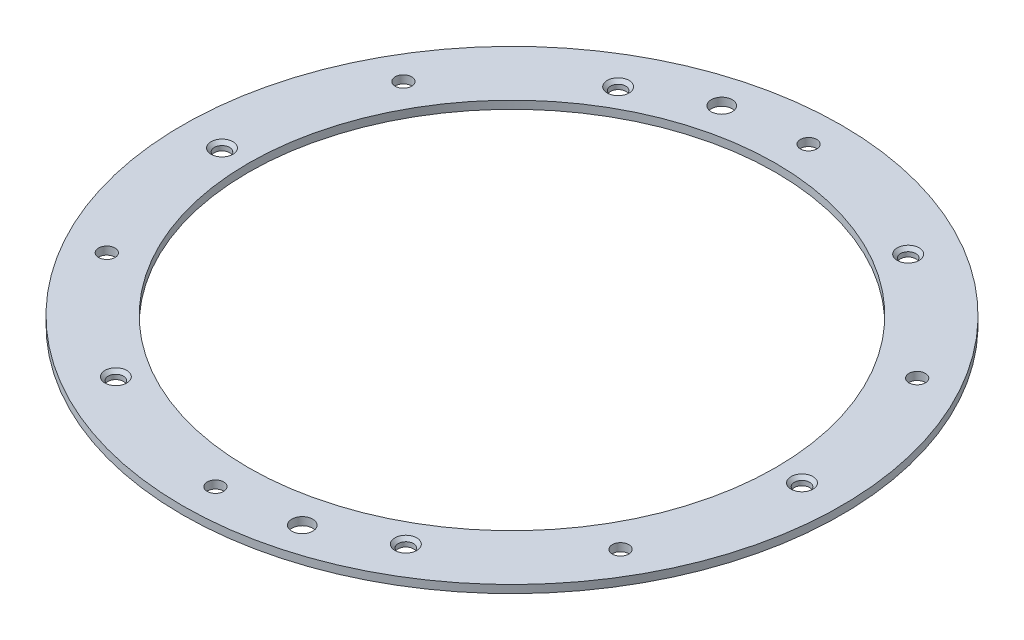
ISO-10303-21;
HEADER;
FILE_DESCRIPTION(('STEP AP214'),'2;1');
FILE_NAME('part.step','',(''),(''),'','','');
FILE_SCHEMA(('AUTOMOTIVE_DESIGN { 1 0 10303 214 1 1 1 1 }'));
ENDSEC;
DATA;
#1=APPLICATION_CONTEXT('core data for automotive mechanical design processes');
#2=APPLICATION_PROTOCOL_DEFINITION('international standard','automotive_design',2000,#1);
#3=PRODUCT_CONTEXT('',#1,'mechanical');
#4=PRODUCT('Part','Part','',(#3));
#5=PRODUCT_RELATED_PRODUCT_CATEGORY('part','',(#4));
#6=PRODUCT_DEFINITION_FORMATION('','',#4);
#7=PRODUCT_DEFINITION_CONTEXT('part definition',#1,'design');
#8=PRODUCT_DEFINITION('design','',#6,#7);
#9=PRODUCT_DEFINITION_SHAPE('','',#8);
#10=(LENGTH_UNIT() NAMED_UNIT(*) SI_UNIT(.MILLI.,.METRE.));
#11=(NAMED_UNIT(*) PLANE_ANGLE_UNIT() SI_UNIT($,.RADIAN.));
#12=(NAMED_UNIT(*) SI_UNIT($,.STERADIAN.) SOLID_ANGLE_UNIT());
#13=UNCERTAINTY_MEASURE_WITH_UNIT(LENGTH_MEASURE(1.E-05),#10,'distance_accuracy_value','');
#14=(GEOMETRIC_REPRESENTATION_CONTEXT(3) GLOBAL_UNCERTAINTY_ASSIGNED_CONTEXT((#13)) GLOBAL_UNIT_ASSIGNED_CONTEXT((#10,
#11,#12)) REPRESENTATION_CONTEXT('',''));
#15=CARTESIAN_POINT('',(0.,0.,0.));
#16=DIRECTION('',(0.,0.,1.));
#17=DIRECTION('',(1.,0.,0.));
#18=AXIS2_PLACEMENT_3D('',#15,#16,#17);
#19=CARTESIAN_POINT('',(0.,1.524,0.));
#20=DIRECTION('',(0.,1.,0.));
#21=DIRECTION('',(0.,0.,1.));
#22=AXIS2_PLACEMENT_3D('',#19,#20,#21);
#23=PLANE('',#22);
#24=CARTESIAN_POINT('',(-14.7915084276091,1.524,-55.2026609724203));
#25=DIRECTION('',(0.,1.,0.));
#26=DIRECTION('',(0.,0.,1.));
#27=AXIS2_PLACEMENT_3D('',#24,#25,#26);
#28=CIRCLE('',#27,2.0193);
#29=CARTESIAN_POINT('',(-14.7915084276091,1.524,-53.1833609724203));
#30=VERTEX_POINT('',#29);
#31=EDGE_CURVE('E151',#30,#30,#28,.T.);
#32=ORIENTED_EDGE('',*,*,#31,.F.);
#33=EDGE_LOOP('',(#32));
#34=FACE_BOUND('',#33,.T.);
#35=CARTESIAN_POINT('',(14.7915084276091,1.524,55.2026609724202));
#36=DIRECTION('',(0.,1.,0.));
#37=DIRECTION('',(0.,0.,1.));
#38=AXIS2_PLACEMENT_3D('',#35,#36,#37);
#39=CIRCLE('',#38,2.0193);
#40=CARTESIAN_POINT('',(14.7915084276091,1.524,57.2219609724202));
#41=VERTEX_POINT('',#40);
#42=EDGE_CURVE('E145',#41,#41,#39,.T.);
#43=ORIENTED_EDGE('',*,*,#42,.F.);
#44=EDGE_LOOP('',(#43));
#45=FACE_BOUND('',#44,.T.);
#46=CARTESIAN_POINT('',(-27.94,1.524,-48.3934995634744));
#47=DIRECTION('',(0.,1.,0.));
#48=DIRECTION('',(0.,0.,1.));
#49=AXIS2_PLACEMENT_3D('',#46,#47,#48);
#50=CIRCLE('',#49,2.1082);
#51=CARTESIAN_POINT('',(-27.94,1.524,-46.2852995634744));
#52=VERTEX_POINT('',#51);
#53=EDGE_CURVE('E139',#52,#52,#50,.T.);
#54=ORIENTED_EDGE('',*,*,#53,.F.);
#55=EDGE_LOOP('',(#54));
#56=FACE_BOUND('',#55,.T.);
#57=CARTESIAN_POINT('',(27.9400000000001,1.524,-48.3934995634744));
#58=DIRECTION('',(0.,1.,0.));
#59=DIRECTION('',(0.,0.,1.));
#60=AXIS2_PLACEMENT_3D('',#57,#58,#59);
#61=CIRCLE('',#60,2.1082);
#62=CARTESIAN_POINT('',(27.9400000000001,1.524,-46.2852995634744));
#63=VERTEX_POINT('',#62);
#64=EDGE_CURVE('E130',#63,#63,#61,.T.);
#65=ORIENTED_EDGE('',*,*,#64,.F.);
#66=EDGE_LOOP('',(#65));
#67=FACE_BOUND('',#66,.T.);
#68=CARTESIAN_POINT('',(55.88,1.524,2.42861286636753E-13));
#69=DIRECTION('',(0.,1.,0.));
#70=DIRECTION('',(0.,0.,1.));
#71=AXIS2_PLACEMENT_3D('',#68,#69,#70);
#72=CIRCLE('',#71,2.1082);
#73=CARTESIAN_POINT('',(55.88,1.524,2.10820000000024));
#74=VERTEX_POINT('',#73);
#75=EDGE_CURVE('E121',#74,#74,#72,.T.);
#76=ORIENTED_EDGE('',*,*,#75,.F.);
#77=EDGE_LOOP('',(#76));
#78=FACE_BOUND('',#77,.T.);
#79=CARTESIAN_POINT('',(27.9399999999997,1.524,48.3934995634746));
#80=DIRECTION('',(0.,1.,0.));
#81=DIRECTION('',(0.,0.,1.));
#82=AXIS2_PLACEMENT_3D('',#79,#80,#81);
#83=CIRCLE('',#82,2.1082);
#84=CARTESIAN_POINT('',(27.9399999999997,1.524,50.5016995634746));
#85=VERTEX_POINT('',#84);
#86=EDGE_CURVE('E112',#85,#85,#83,.T.);
#87=ORIENTED_EDGE('',*,*,#86,.F.);
#88=EDGE_LOOP('',(#87));
#89=FACE_BOUND('',#88,.T.);
#90=CARTESIAN_POINT('',(-27.9400000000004,1.524,48.3934995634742));
#91=DIRECTION('',(0.,1.,0.));
#92=DIRECTION('',(0.,0.,1.));
#93=AXIS2_PLACEMENT_3D('',#90,#91,#92);
#94=CIRCLE('',#93,2.1082);
#95=CARTESIAN_POINT('',(-27.9400000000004,1.524,50.5016995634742));
#96=VERTEX_POINT('',#95);
#97=EDGE_CURVE('E103',#96,#96,#94,.T.);
#98=ORIENTED_EDGE('',*,*,#97,.F.);
#99=EDGE_LOOP('',(#98));
#100=FACE_BOUND('',#99,.T.);
#101=CARTESIAN_POINT('',(-55.88,1.524,-6.27969898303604E-13));
#102=DIRECTION('',(0.,1.,0.));
#103=DIRECTION('',(0.,0.,1.));
#104=AXIS2_PLACEMENT_3D('',#101,#102,#103);
#105=CIRCLE('',#104,2.1082);
#106=CARTESIAN_POINT('',(-55.88,1.524,2.10819999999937));
#107=VERTEX_POINT('',#106);
#108=EDGE_CURVE('E94',#107,#107,#105,.T.);
#109=ORIENTED_EDGE('',*,*,#108,.F.);
#110=EDGE_LOOP('',(#109));
#111=FACE_BOUND('',#110,.T.);
#112=CARTESIAN_POINT('',(49.4933518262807,1.524,-28.575));
#113=DIRECTION('',(0.,1.,0.));
#114=DIRECTION('',(0.,0.,1.));
#115=AXIS2_PLACEMENT_3D('',#112,#113,#114);
#116=CIRCLE('',#115,1.58750000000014);
#117=CARTESIAN_POINT('',(49.4933518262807,1.524,-26.9874999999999));
#118=VERTEX_POINT('',#117);
#119=EDGE_CURVE('E84',#118,#118,#116,.T.);
#120=ORIENTED_EDGE('',*,*,#119,.F.);
#121=EDGE_LOOP('',(#120));
#122=FACE_BOUND('',#121,.T.);
#123=CARTESIAN_POINT('',(49.4933518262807,1.524,28.575));
#124=DIRECTION('',(0.,1.,0.));
#125=DIRECTION('',(0.,0.,1.));
#126=AXIS2_PLACEMENT_3D('',#123,#124,#125);
#127=CIRCLE('',#126,1.5875);
#128=CARTESIAN_POINT('',(49.4933518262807,1.524,30.1625));
#129=VERTEX_POINT('',#128);
#130=EDGE_CURVE('E78',#129,#129,#127,.T.);
#131=ORIENTED_EDGE('',*,*,#130,.F.);
#132=EDGE_LOOP('',(#131));
#133=FACE_BOUND('',#132,.T.);
#134=CARTESIAN_POINT('',(0.,1.524,57.15));
#135=DIRECTION('',(0.,1.,0.));
#136=DIRECTION('',(0.,0.,1.));
#137=AXIS2_PLACEMENT_3D('',#134,#135,#136);
#138=CIRCLE('',#137,1.5875);
#139=CARTESIAN_POINT('',(0.,1.524,58.7375));
#140=VERTEX_POINT('',#139);
#141=EDGE_CURVE('E72',#140,#140,#138,.T.);
#142=ORIENTED_EDGE('',*,*,#141,.F.);
#143=EDGE_LOOP('',(#142));
#144=FACE_BOUND('',#143,.T.);
#145=CARTESIAN_POINT('',(-49.4933518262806,1.524,28.575));
#146=DIRECTION('',(0.,1.,0.));
#147=DIRECTION('',(0.,0.,1.));
#148=AXIS2_PLACEMENT_3D('',#145,#146,#147);
#149=CIRCLE('',#148,1.5875);
#150=CARTESIAN_POINT('',(-49.4933518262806,1.524,30.1625));
#151=VERTEX_POINT('',#150);
#152=EDGE_CURVE('E66',#151,#151,#149,.T.);
#153=ORIENTED_EDGE('',*,*,#152,.F.);
#154=EDGE_LOOP('',(#153));
#155=FACE_BOUND('',#154,.T.);
#156=CARTESIAN_POINT('',(-49.4933518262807,1.524,-28.575));
#157=DIRECTION('',(0.,1.,0.));
#158=DIRECTION('',(0.,0.,1.));
#159=AXIS2_PLACEMENT_3D('',#156,#157,#158);
#160=CIRCLE('',#159,1.5875);
#161=CARTESIAN_POINT('',(-49.4933518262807,1.524,-26.9875));
#162=VERTEX_POINT('',#161);
#163=EDGE_CURVE('E59',#162,#162,#160,.T.);
#164=ORIENTED_EDGE('',*,*,#163,.F.);
#165=EDGE_LOOP('',(#164));
#166=FACE_BOUND('',#165,.T.);
#167=CARTESIAN_POINT('',(0.,1.524,-57.15));
#168=DIRECTION('',(0.,1.,0.));
#169=DIRECTION('',(0.,0.,1.));
#170=AXIS2_PLACEMENT_3D('',#167,#168,#169);
#171=CIRCLE('',#170,1.5875);
#172=CARTESIAN_POINT('',(0.,1.524,-55.5625));
#173=VERTEX_POINT('',#172);
#174=EDGE_CURVE('E53',#173,#173,#171,.T.);
#175=ORIENTED_EDGE('',*,*,#174,.F.);
#176=EDGE_LOOP('',(#175));
#177=FACE_BOUND('',#176,.T.);
#178=CARTESIAN_POINT('',(0.,1.524,0.));
#179=DIRECTION('',(0.,1.,0.));
#180=DIRECTION('',(0.,0.,1.));
#181=AXIS2_PLACEMENT_3D('',#178,#179,#180);
#182=CIRCLE('',#181,63.5);
#183=CARTESIAN_POINT('',(0.,1.524,-63.5));
#184=VERTEX_POINT('',#183);
#185=EDGE_CURVE('E10',#184,#184,#182,.T.);
#186=ORIENTED_EDGE('',*,*,#185,.T.);
#187=EDGE_LOOP('',(#186));
#188=FACE_BOUND('',#187,.T.);
#189=CARTESIAN_POINT('',(0.,1.524,0.));
#190=DIRECTION('',(0.,1.,0.));
#191=DIRECTION('',(0.,0.,1.));
#192=AXIS2_PLACEMENT_3D('',#189,#190,#191);
#193=CIRCLE('',#192,50.8);
#194=CARTESIAN_POINT('',(0.,1.524,-50.8));
#195=VERTEX_POINT('',#194);
#196=EDGE_CURVE('E45',#195,#195,#193,.T.);
#197=ORIENTED_EDGE('',*,*,#196,.F.);
#198=EDGE_LOOP('',(#197));
#199=FACE_BOUND('',#198,.T.);
#200=ADVANCED_FACE('F34',(#34,#45,#56,#67,#78,#89,#100,#111,#122,#133,#144,#155,#166,#177,#188,
#199),#23,.T.);
#201=CARTESIAN_POINT('',(0.,0.,0.));
#202=DIRECTION('',(0.,1.,0.));
#203=DIRECTION('',(0.,0.,1.));
#204=AXIS2_PLACEMENT_3D('',#201,#202,#203);
#205=PLANE('',#204);
#206=CARTESIAN_POINT('',(-14.7915084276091,0.,-55.2026609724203));
#207=DIRECTION('',(0.,1.,0.));
#208=DIRECTION('',(0.,0.,1.));
#209=AXIS2_PLACEMENT_3D('',#206,#207,#208);
#210=CIRCLE('',#209,2.0193);
#211=CARTESIAN_POINT('',(-14.7915084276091,0.,-53.1833609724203));
#212=VERTEX_POINT('',#211);
#213=EDGE_CURVE('E148',#212,#212,#210,.T.);
#214=ORIENTED_EDGE('',*,*,#213,.T.);
#215=EDGE_LOOP('',(#214));
#216=FACE_BOUND('',#215,.T.);
#217=CARTESIAN_POINT('',(14.7915084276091,0.,55.2026609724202));
#218=DIRECTION('',(0.,1.,0.));
#219=DIRECTION('',(0.,0.,1.));
#220=AXIS2_PLACEMENT_3D('',#217,#218,#219);
#221=CIRCLE('',#220,2.0193);
#222=CARTESIAN_POINT('',(14.7915084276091,0.,57.2219609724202));
#223=VERTEX_POINT('',#222);
#224=EDGE_CURVE('E142',#223,#223,#221,.T.);
#225=ORIENTED_EDGE('',*,*,#224,.T.);
#226=EDGE_LOOP('',(#225));
#227=FACE_BOUND('',#226,.T.);
#228=CARTESIAN_POINT('',(-27.94,0.,-48.3934995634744));
#229=DIRECTION('',(0.,1.,0.));
#230=DIRECTION('',(0.,0.,1.));
#231=AXIS2_PLACEMENT_3D('',#228,#229,#230);
#232=CIRCLE('',#231,1.4732);
#233=CARTESIAN_POINT('',(-27.94,0.,-46.9202995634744));
#234=VERTEX_POINT('',#233);
#235=EDGE_CURVE('E133',#234,#234,#232,.T.);
#236=ORIENTED_EDGE('',*,*,#235,.T.);
#237=EDGE_LOOP('',(#236));
#238=FACE_BOUND('',#237,.T.);
#239=CARTESIAN_POINT('',(27.9400000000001,0.,-48.3934995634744));
#240=DIRECTION('',(0.,1.,0.));
#241=DIRECTION('',(0.,0.,1.));
#242=AXIS2_PLACEMENT_3D('',#239,#240,#241);
#243=CIRCLE('',#242,1.4732);
#244=CARTESIAN_POINT('',(27.9400000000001,0.,-46.9202995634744));
#245=VERTEX_POINT('',#244);
#246=EDGE_CURVE('E124',#245,#245,#243,.T.);
#247=ORIENTED_EDGE('',*,*,#246,.T.);
#248=EDGE_LOOP('',(#247));
#249=FACE_BOUND('',#248,.T.);
#250=CARTESIAN_POINT('',(55.88,0.,2.42861286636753E-13));
#251=DIRECTION('',(0.,1.,0.));
#252=DIRECTION('',(0.,0.,1.));
#253=AXIS2_PLACEMENT_3D('',#250,#251,#252);
#254=CIRCLE('',#253,1.4732);
#255=CARTESIAN_POINT('',(55.88,0.,1.47320000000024));
#256=VERTEX_POINT('',#255);
#257=EDGE_CURVE('E115',#256,#256,#254,.T.);
#258=ORIENTED_EDGE('',*,*,#257,.T.);
#259=EDGE_LOOP('',(#258));
#260=FACE_BOUND('',#259,.T.);
#261=CARTESIAN_POINT('',(27.9399999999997,0.,48.3934995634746));
#262=DIRECTION('',(0.,1.,0.));
#263=DIRECTION('',(0.,0.,1.));
#264=AXIS2_PLACEMENT_3D('',#261,#262,#263);
#265=CIRCLE('',#264,1.4732);
#266=CARTESIAN_POINT('',(27.9399999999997,0.,49.8666995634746));
#267=VERTEX_POINT('',#266);
#268=EDGE_CURVE('E106',#267,#267,#265,.T.);
#269=ORIENTED_EDGE('',*,*,#268,.T.);
#270=EDGE_LOOP('',(#269));
#271=FACE_BOUND('',#270,.T.);
#272=CARTESIAN_POINT('',(-27.9400000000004,0.,48.3934995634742));
#273=DIRECTION('',(0.,1.,0.));
#274=DIRECTION('',(0.,0.,1.));
#275=AXIS2_PLACEMENT_3D('',#272,#273,#274);
#276=CIRCLE('',#275,1.4732);
#277=CARTESIAN_POINT('',(-27.9400000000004,0.,49.8666995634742));
#278=VERTEX_POINT('',#277);
#279=EDGE_CURVE('E97',#278,#278,#276,.T.);
#280=ORIENTED_EDGE('',*,*,#279,.T.);
#281=EDGE_LOOP('',(#280));
#282=FACE_BOUND('',#281,.T.);
#283=CARTESIAN_POINT('',(-55.88,0.,-6.27969898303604E-13));
#284=DIRECTION('',(0.,1.,0.));
#285=DIRECTION('',(0.,0.,1.));
#286=AXIS2_PLACEMENT_3D('',#283,#284,#285);
#287=CIRCLE('',#286,1.4732);
#288=CARTESIAN_POINT('',(-55.88,0.,1.47319999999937));
#289=VERTEX_POINT('',#288);
#290=EDGE_CURVE('E63',#289,#289,#287,.T.);
#291=ORIENTED_EDGE('',*,*,#290,.T.);
#292=EDGE_LOOP('',(#291));
#293=FACE_BOUND('',#292,.T.);
#294=CARTESIAN_POINT('',(49.4933518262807,0.,-28.575));
#295=DIRECTION('',(0.,1.,0.));
#296=DIRECTION('',(0.,0.,1.));
#297=AXIS2_PLACEMENT_3D('',#294,#295,#296);
#298=CIRCLE('',#297,1.58750000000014);
#299=CARTESIAN_POINT('',(49.4933518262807,0.,-26.9874999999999));
#300=VERTEX_POINT('',#299);
#301=EDGE_CURVE('E56',#300,#300,#298,.T.);
#302=ORIENTED_EDGE('',*,*,#301,.T.);
#303=EDGE_LOOP('',(#302));
#304=FACE_BOUND('',#303,.T.);
#305=CARTESIAN_POINT('',(49.4933518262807,0.,28.575));
#306=DIRECTION('',(0.,1.,0.));
#307=DIRECTION('',(0.,0.,1.));
#308=AXIS2_PLACEMENT_3D('',#305,#306,#307);
#309=CIRCLE('',#308,1.5875);
#310=CARTESIAN_POINT('',(49.4933518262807,0.,30.1625));
#311=VERTEX_POINT('',#310);
#312=EDGE_CURVE('E81',#311,#311,#309,.T.);
#313=ORIENTED_EDGE('',*,*,#312,.T.);
#314=EDGE_LOOP('',(#313));
#315=FACE_BOUND('',#314,.T.);
#316=CARTESIAN_POINT('',(0.,0.,57.15));
#317=DIRECTION('',(0.,1.,0.));
#318=DIRECTION('',(0.,0.,1.));
#319=AXIS2_PLACEMENT_3D('',#316,#317,#318);
#320=CIRCLE('',#319,1.5875);
#321=CARTESIAN_POINT('',(0.,0.,58.7375));
#322=VERTEX_POINT('',#321);
#323=EDGE_CURVE('E75',#322,#322,#320,.T.);
#324=ORIENTED_EDGE('',*,*,#323,.T.);
#325=EDGE_LOOP('',(#324));
#326=FACE_BOUND('',#325,.T.);
#327=CARTESIAN_POINT('',(-49.4933518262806,0.,28.575));
#328=DIRECTION('',(0.,1.,0.));
#329=DIRECTION('',(0.,0.,1.));
#330=AXIS2_PLACEMENT_3D('',#327,#328,#329);
#331=CIRCLE('',#330,1.5875);
#332=CARTESIAN_POINT('',(-49.4933518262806,0.,30.1625));
#333=VERTEX_POINT('',#332);
#334=EDGE_CURVE('E69',#333,#333,#331,.T.);
#335=ORIENTED_EDGE('',*,*,#334,.T.);
#336=EDGE_LOOP('',(#335));
#337=FACE_BOUND('',#336,.T.);
#338=CARTESIAN_POINT('',(-49.4933518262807,0.,-28.575));
#339=DIRECTION('',(0.,1.,0.));
#340=DIRECTION('',(0.,0.,1.));
#341=AXIS2_PLACEMENT_3D('',#338,#339,#340);
#342=CIRCLE('',#341,1.5875);
#343=CARTESIAN_POINT('',(-49.4933518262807,0.,-26.9875));
#344=VERTEX_POINT('',#343);
#345=EDGE_CURVE('E62',#344,#344,#342,.T.);
#346=ORIENTED_EDGE('',*,*,#345,.T.);
#347=EDGE_LOOP('',(#346));
#348=FACE_BOUND('',#347,.T.);
#349=CARTESIAN_POINT('',(0.,0.,-57.15));
#350=DIRECTION('',(0.,1.,0.));
#351=DIRECTION('',(0.,0.,1.));
#352=AXIS2_PLACEMENT_3D('',#349,#350,#351);
#353=CIRCLE('',#352,1.5875);
#354=CARTESIAN_POINT('',(0.,0.,-55.5625));
#355=VERTEX_POINT('',#354);
#356=EDGE_CURVE('E50',#355,#355,#353,.T.);
#357=ORIENTED_EDGE('',*,*,#356,.T.);
#358=EDGE_LOOP('',(#357));
#359=FACE_BOUND('',#358,.T.);
#360=CARTESIAN_POINT('',(0.,0.,0.));
#361=DIRECTION('',(0.,1.,0.));
#362=DIRECTION('',(0.,0.,1.));
#363=AXIS2_PLACEMENT_3D('',#360,#361,#362);
#364=CIRCLE('',#363,63.5);
#365=CARTESIAN_POINT('',(0.,0.,-63.5));
#366=VERTEX_POINT('',#365);
#367=EDGE_CURVE('E38',#366,#366,#364,.T.);
#368=ORIENTED_EDGE('',*,*,#367,.F.);
#369=EDGE_LOOP('',(#368));
#370=FACE_BOUND('',#369,.T.);
#371=CARTESIAN_POINT('',(0.,0.,0.));
#372=DIRECTION('',(0.,1.,0.));
#373=DIRECTION('',(0.,0.,1.));
#374=AXIS2_PLACEMENT_3D('',#371,#372,#373);
#375=CIRCLE('',#374,50.8);
#376=CARTESIAN_POINT('',(0.,0.,-50.8));
#377=VERTEX_POINT('',#376);
#378=EDGE_CURVE('E47',#377,#377,#375,.T.);
#379=ORIENTED_EDGE('',*,*,#378,.T.);
#380=EDGE_LOOP('',(#379));
#381=FACE_BOUND('',#380,.T.);
#382=ADVANCED_FACE('F159',(#216,#227,#238,#249,#260,#271,#282,#293,#304,#315,#326,#337,#348,
#359,#370,#381),#205,.F.);
#383=CARTESIAN_POINT('',(0.,1.524,0.));
#384=DIRECTION('',(0.,-1.,0.));
#385=DIRECTION('',(0.,0.,-1.));
#386=AXIS2_PLACEMENT_3D('',#383,#384,#385);
#387=CYLINDRICAL_SURFACE('',#386,63.5);
#388=CARTESIAN_POINT('',(0.,1.524,-63.5));
#389=CARTESIAN_POINT('',(0.,1.508125,-63.5));
#390=CARTESIAN_POINT('',(0.,1.49225,-63.5));
#391=CARTESIAN_POINT('',(0.,1.4605,-63.5));
#392=CARTESIAN_POINT('',(0.,1.444625,-63.5));
#393=CARTESIAN_POINT('',(0.,1.412875,-63.5));
#394=CARTESIAN_POINT('',(0.,1.397,-63.5));
#395=CARTESIAN_POINT('',(0.,1.36525,-63.5));
#396=CARTESIAN_POINT('',(0.,1.349375,-63.5));
#397=CARTESIAN_POINT('',(0.,1.317625,-63.5));
#398=CARTESIAN_POINT('',(0.,1.30175,-63.5));
#399=CARTESIAN_POINT('',(0.,1.27,-63.5));
#400=CARTESIAN_POINT('',(0.,1.254125,-63.5));
#401=CARTESIAN_POINT('',(0.,1.222375,-63.5));
#402=CARTESIAN_POINT('',(0.,1.2065,-63.5));
#403=CARTESIAN_POINT('',(0.,1.17475,-63.5));
#404=CARTESIAN_POINT('',(0.,1.158875,-63.5));
#405=CARTESIAN_POINT('',(0.,1.127125,-63.5));
#406=CARTESIAN_POINT('',(0.,1.11125,-63.5));
#407=CARTESIAN_POINT('',(0.,1.0795,-63.5));
#408=CARTESIAN_POINT('',(0.,1.063625,-63.5));
#409=CARTESIAN_POINT('',(0.,1.031875,-63.5));
#410=CARTESIAN_POINT('',(0.,1.016,-63.5));
#411=CARTESIAN_POINT('',(0.,0.98425,-63.5));
#412=CARTESIAN_POINT('',(0.,0.968375,-63.5));
#413=CARTESIAN_POINT('',(0.,0.936625,-63.5));
#414=CARTESIAN_POINT('',(0.,0.92075,-63.5));
#415=CARTESIAN_POINT('',(0.,0.889,-63.5));
#416=CARTESIAN_POINT('',(0.,0.873125,-63.5));
#417=CARTESIAN_POINT('',(0.,0.841375,-63.5));
#418=CARTESIAN_POINT('',(0.,0.8255,-63.5));
#419=CARTESIAN_POINT('',(0.,0.79375,-63.5));
#420=CARTESIAN_POINT('',(0.,0.777875,-63.5));
#421=CARTESIAN_POINT('',(0.,0.746125,-63.5));
#422=CARTESIAN_POINT('',(0.,0.73025,-63.5));
#423=CARTESIAN_POINT('',(0.,0.6985,-63.5));
#424=CARTESIAN_POINT('',(0.,0.682625,-63.5));
#425=CARTESIAN_POINT('',(0.,0.650875,-63.5));
#426=CARTESIAN_POINT('',(0.,0.635,-63.5));
#427=CARTESIAN_POINT('',(0.,0.60325,-63.5));
#428=CARTESIAN_POINT('',(0.,0.587375,-63.5));
#429=CARTESIAN_POINT('',(0.,0.555625,-63.5));
#430=CARTESIAN_POINT('',(0.,0.53975,-63.5));
#431=CARTESIAN_POINT('',(0.,0.508,-63.5));
#432=CARTESIAN_POINT('',(0.,0.492125,-63.5));
#433=CARTESIAN_POINT('',(0.,0.460375,-63.5));
#434=CARTESIAN_POINT('',(0.,0.4445,-63.5));
#435=CARTESIAN_POINT('',(0.,0.41275,-63.5));
#436=CARTESIAN_POINT('',(0.,0.396875,-63.5));
#437=CARTESIAN_POINT('',(0.,0.365125,-63.5));
#438=CARTESIAN_POINT('',(0.,0.34925,-63.5));
#439=CARTESIAN_POINT('',(0.,0.3175,-63.5));
#440=CARTESIAN_POINT('',(0.,0.301625,-63.5));
#441=CARTESIAN_POINT('',(0.,0.269875,-63.5));
#442=CARTESIAN_POINT('',(0.,0.254,-63.5));
#443=CARTESIAN_POINT('',(0.,0.22225,-63.5));
#444=CARTESIAN_POINT('',(0.,0.206375,-63.5));
#445=CARTESIAN_POINT('',(0.,0.174625,-63.5));
#446=CARTESIAN_POINT('',(0.,0.15875,-63.5));
#447=CARTESIAN_POINT('',(0.,0.127,-63.5));
#448=CARTESIAN_POINT('',(0.,0.111125,-63.5));
#449=CARTESIAN_POINT('',(0.,0.079375,-63.5));
#450=CARTESIAN_POINT('',(0.,0.0635,-63.5));
#451=CARTESIAN_POINT('',(0.,0.0317499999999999,-63.5));
#452=CARTESIAN_POINT('',(0.,0.015875,-63.5));
#453=CARTESIAN_POINT('',(0.,0.,-63.5));
#454=B_SPLINE_CURVE_WITH_KNOTS('',3,(#388,#389,#390,#391,#392,#393,#394,#395,#396,#397,#398,
#399,#400,#401,#402,#403,#404,#405,#406,#407,#408,#409,#410,#411,#412,#413,#414,#415,#416,#417,
#418,#419,#420,#421,#422,#423,#424,#425,#426,#427,#428,#429,#430,#431,#432,#433,#434,#435,#436,
#437,#438,#439,#440,#441,#442,#443,#444,#445,#446,#447,#448,#449,#450,#451,#452,#453),
.UNSPECIFIED.,.F.,.F.,(4,2,2,2,2,2,2,2,2,2,2,2,2,2,2,2,2,2,2,2,2,2,2,2,2,2,2,2,2,2,2,2,4),(0.,
0.0476249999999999,0.0952499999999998,0.142875,0.1905,0.238125,0.28575,0.333375,0.381,0.428625,
0.47625,0.523875,0.5715,0.619125,0.66675,0.714375,0.762,0.809625,0.85725,0.904875,0.9525,
1.000125,1.04775,1.095375,1.143,1.190625,1.23825,1.285875,1.3335,1.381125,1.42875,1.476375,
1.524),.UNSPECIFIED.);
#455=EDGE_CURVE('BSEAM36',#184,#366,#454,.T.);
#456=ORIENTED_EDGE('',*,*,#185,.F.);
#457=ORIENTED_EDGE('',*,*,#367,.T.);
#458=ORIENTED_EDGE('',*,*,#455,.T.);
#459=ORIENTED_EDGE('',*,*,#455,.F.);
#460=EDGE_LOOP('',(#456,#458,#457,#459));
#461=FACE_BOUND('',#460,.T.);
#462=ADVANCED_FACE('F36',(#461),#387,.T.);
#463=CARTESIAN_POINT('',(0.,1.524,0.));
#464=DIRECTION('',(0.,-1.,0.));
#465=DIRECTION('',(0.,0.,-1.));
#466=AXIS2_PLACEMENT_3D('',#463,#464,#465);
#467=CYLINDRICAL_SURFACE('',#466,50.8);
#468=CARTESIAN_POINT('',(0.,1.524,-50.8));
#469=CARTESIAN_POINT('',(0.,1.508125,-50.8));
#470=CARTESIAN_POINT('',(0.,1.49225,-50.8));
#471=CARTESIAN_POINT('',(0.,1.4605,-50.8));
#472=CARTESIAN_POINT('',(0.,1.444625,-50.8));
#473=CARTESIAN_POINT('',(0.,1.412875,-50.8));
#474=CARTESIAN_POINT('',(0.,1.397,-50.8));
#475=CARTESIAN_POINT('',(0.,1.36525,-50.8));
#476=CARTESIAN_POINT('',(0.,1.349375,-50.8));
#477=CARTESIAN_POINT('',(0.,1.317625,-50.8));
#478=CARTESIAN_POINT('',(0.,1.30175,-50.8));
#479=CARTESIAN_POINT('',(0.,1.27,-50.8));
#480=CARTESIAN_POINT('',(0.,1.254125,-50.8));
#481=CARTESIAN_POINT('',(0.,1.222375,-50.8));
#482=CARTESIAN_POINT('',(0.,1.2065,-50.8));
#483=CARTESIAN_POINT('',(0.,1.17475,-50.8));
#484=CARTESIAN_POINT('',(0.,1.158875,-50.8));
#485=CARTESIAN_POINT('',(0.,1.127125,-50.8));
#486=CARTESIAN_POINT('',(0.,1.11125,-50.8));
#487=CARTESIAN_POINT('',(0.,1.0795,-50.8));
#488=CARTESIAN_POINT('',(0.,1.063625,-50.8));
#489=CARTESIAN_POINT('',(0.,1.031875,-50.8));
#490=CARTESIAN_POINT('',(0.,1.016,-50.8));
#491=CARTESIAN_POINT('',(0.,0.98425,-50.8));
#492=CARTESIAN_POINT('',(0.,0.968375,-50.8));
#493=CARTESIAN_POINT('',(0.,0.936625,-50.8));
#494=CARTESIAN_POINT('',(0.,0.92075,-50.8));
#495=CARTESIAN_POINT('',(0.,0.889,-50.8));
#496=CARTESIAN_POINT('',(0.,0.873125,-50.8));
#497=CARTESIAN_POINT('',(0.,0.841375,-50.8));
#498=CARTESIAN_POINT('',(0.,0.8255,-50.8));
#499=CARTESIAN_POINT('',(0.,0.79375,-50.8));
#500=CARTESIAN_POINT('',(0.,0.777875,-50.8));
#501=CARTESIAN_POINT('',(0.,0.746125,-50.8));
#502=CARTESIAN_POINT('',(0.,0.73025,-50.8));
#503=CARTESIAN_POINT('',(0.,0.6985,-50.8));
#504=CARTESIAN_POINT('',(0.,0.682625,-50.8));
#505=CARTESIAN_POINT('',(0.,0.650875,-50.8));
#506=CARTESIAN_POINT('',(0.,0.635,-50.8));
#507=CARTESIAN_POINT('',(0.,0.60325,-50.8));
#508=CARTESIAN_POINT('',(0.,0.587375,-50.8));
#509=CARTESIAN_POINT('',(0.,0.555625,-50.8));
#510=CARTESIAN_POINT('',(0.,0.53975,-50.8));
#511=CARTESIAN_POINT('',(0.,0.508,-50.8));
#512=CARTESIAN_POINT('',(0.,0.492125,-50.8));
#513=CARTESIAN_POINT('',(0.,0.460375,-50.8));
#514=CARTESIAN_POINT('',(0.,0.4445,-50.8));
#515=CARTESIAN_POINT('',(0.,0.41275,-50.8));
#516=CARTESIAN_POINT('',(0.,0.396875,-50.8));
#517=CARTESIAN_POINT('',(0.,0.365125,-50.8));
#518=CARTESIAN_POINT('',(0.,0.34925,-50.8));
#519=CARTESIAN_POINT('',(0.,0.3175,-50.8));
#520=CARTESIAN_POINT('',(0.,0.301625,-50.8));
#521=CARTESIAN_POINT('',(0.,0.269875,-50.8));
#522=CARTESIAN_POINT('',(0.,0.254,-50.8));
#523=CARTESIAN_POINT('',(0.,0.22225,-50.8));
#524=CARTESIAN_POINT('',(0.,0.206375,-50.8));
#525=CARTESIAN_POINT('',(0.,0.174625,-50.8));
#526=CARTESIAN_POINT('',(0.,0.15875,-50.8));
#527=CARTESIAN_POINT('',(0.,0.127,-50.8));
#528=CARTESIAN_POINT('',(0.,0.111125,-50.8));
#529=CARTESIAN_POINT('',(0.,0.079375,-50.8));
#530=CARTESIAN_POINT('',(0.,0.0635,-50.8));
#531=CARTESIAN_POINT('',(0.,0.0317499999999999,-50.8));
#532=CARTESIAN_POINT('',(0.,0.015875,-50.8));
#533=CARTESIAN_POINT('',(0.,0.,-50.8));
#534=B_SPLINE_CURVE_WITH_KNOTS('',3,(#468,#469,#470,#471,#472,#473,#474,#475,#476,#477,#478,
#479,#480,#481,#482,#483,#484,#485,#486,#487,#488,#489,#490,#491,#492,#493,#494,#495,#496,#497,
#498,#499,#500,#501,#502,#503,#504,#505,#506,#507,#508,#509,#510,#511,#512,#513,#514,#515,#516,
#517,#518,#519,#520,#521,#522,#523,#524,#525,#526,#527,#528,#529,#530,#531,#532,#533),
.UNSPECIFIED.,.F.,.F.,(4,2,2,2,2,2,2,2,2,2,2,2,2,2,2,2,2,2,2,2,2,2,2,2,2,2,2,2,2,2,2,2,4),(0.,
0.0476250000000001,0.0952500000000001,0.142875,0.1905,0.238125,0.28575,0.333375,0.381,0.428625,
0.47625,0.523875,0.5715,0.619125,0.66675,0.714375,0.762,0.809625,0.85725,0.904875,0.9525,
1.000125,1.04775,1.095375,1.143,1.190625,1.23825,1.285875,1.3335,1.381125,1.42875,1.476375,
1.524),.UNSPECIFIED.);
#535=EDGE_CURVE('BSEAM189',#195,#377,#534,.T.);
#536=ORIENTED_EDGE('',*,*,#196,.T.);
#537=ORIENTED_EDGE('',*,*,#378,.F.);
#538=ORIENTED_EDGE('',*,*,#535,.T.);
#539=ORIENTED_EDGE('',*,*,#535,.F.);
#540=EDGE_LOOP('',(#536,#538,#537,#539));
#541=FACE_BOUND('',#540,.T.);
#542=ADVANCED_FACE('F189',(#541),#467,.F.);
#543=CARTESIAN_POINT('',(0.,0.,-57.15));
#544=DIRECTION('',(0.,1.,0.));
#545=DIRECTION('',(0.,0.,1.));
#546=AXIS2_PLACEMENT_3D('',#543,#544,#545);
#547=CYLINDRICAL_SURFACE('',#546,1.5875);
#548=CARTESIAN_POINT('',(0.,0.,-55.5625));
#549=CARTESIAN_POINT('',(0.,0.015875,-55.5625));
#550=CARTESIAN_POINT('',(0.,0.03175,-55.5625));
#551=CARTESIAN_POINT('',(0.,0.0635,-55.5625));
#552=CARTESIAN_POINT('',(0.,0.079375,-55.5625));
#553=CARTESIAN_POINT('',(0.,0.111125,-55.5625));
#554=CARTESIAN_POINT('',(0.,0.127,-55.5625));
#555=CARTESIAN_POINT('',(0.,0.15875,-55.5625));
#556=CARTESIAN_POINT('',(0.,0.174625,-55.5625));
#557=CARTESIAN_POINT('',(0.,0.206375,-55.5625));
#558=CARTESIAN_POINT('',(0.,0.22225,-55.5625));
#559=CARTESIAN_POINT('',(0.,0.254,-55.5625));
#560=CARTESIAN_POINT('',(0.,0.269875,-55.5625));
#561=CARTESIAN_POINT('',(0.,0.301625,-55.5625));
#562=CARTESIAN_POINT('',(0.,0.3175,-55.5625));
#563=CARTESIAN_POINT('',(0.,0.34925,-55.5625));
#564=CARTESIAN_POINT('',(0.,0.365125,-55.5625));
#565=CARTESIAN_POINT('',(0.,0.396875,-55.5625));
#566=CARTESIAN_POINT('',(0.,0.41275,-55.5625));
#567=CARTESIAN_POINT('',(0.,0.4445,-55.5625));
#568=CARTESIAN_POINT('',(0.,0.460375,-55.5625));
#569=CARTESIAN_POINT('',(0.,0.492125,-55.5625));
#570=CARTESIAN_POINT('',(0.,0.508,-55.5625));
#571=CARTESIAN_POINT('',(0.,0.53975,-55.5625));
#572=CARTESIAN_POINT('',(0.,0.555625,-55.5625));
#573=CARTESIAN_POINT('',(0.,0.587375,-55.5625));
#574=CARTESIAN_POINT('',(0.,0.60325,-55.5625));
#575=CARTESIAN_POINT('',(0.,0.635,-55.5625));
#576=CARTESIAN_POINT('',(0.,0.650875,-55.5625));
#577=CARTESIAN_POINT('',(0.,0.682625,-55.5625));
#578=CARTESIAN_POINT('',(0.,0.6985,-55.5625));
#579=CARTESIAN_POINT('',(0.,0.73025,-55.5625));
#580=CARTESIAN_POINT('',(0.,0.746125,-55.5625));
#581=CARTESIAN_POINT('',(0.,0.777875,-55.5625));
#582=CARTESIAN_POINT('',(0.,0.79375,-55.5625));
#583=CARTESIAN_POINT('',(0.,0.8255,-55.5625));
#584=CARTESIAN_POINT('',(0.,0.841375,-55.5625));
#585=CARTESIAN_POINT('',(0.,0.873125,-55.5625));
#586=CARTESIAN_POINT('',(0.,0.889,-55.5625));
#587=CARTESIAN_POINT('',(0.,0.92075,-55.5625));
#588=CARTESIAN_POINT('',(0.,0.936625,-55.5625));
#589=CARTESIAN_POINT('',(0.,0.968375,-55.5625));
#590=CARTESIAN_POINT('',(0.,0.98425,-55.5625));
#591=CARTESIAN_POINT('',(0.,1.016,-55.5625));
#592=CARTESIAN_POINT('',(0.,1.031875,-55.5625));
#593=CARTESIAN_POINT('',(0.,1.063625,-55.5625));
#594=CARTESIAN_POINT('',(0.,1.0795,-55.5625));
#595=CARTESIAN_POINT('',(0.,1.11125,-55.5625));
#596=CARTESIAN_POINT('',(0.,1.127125,-55.5625));
#597=CARTESIAN_POINT('',(0.,1.158875,-55.5625));
#598=CARTESIAN_POINT('',(0.,1.17475,-55.5625));
#599=CARTESIAN_POINT('',(0.,1.2065,-55.5625));
#600=CARTESIAN_POINT('',(0.,1.222375,-55.5625));
#601=CARTESIAN_POINT('',(0.,1.254125,-55.5625));
#602=CARTESIAN_POINT('',(0.,1.27,-55.5625));
#603=CARTESIAN_POINT('',(0.,1.30175,-55.5625));
#604=CARTESIAN_POINT('',(0.,1.317625,-55.5625));
#605=CARTESIAN_POINT('',(0.,1.349375,-55.5625));
#606=CARTESIAN_POINT('',(0.,1.36525,-55.5625));
#607=CARTESIAN_POINT('',(0.,1.397,-55.5625));
#608=CARTESIAN_POINT('',(0.,1.412875,-55.5625));
#609=CARTESIAN_POINT('',(0.,1.444625,-55.5625));
#610=CARTESIAN_POINT('',(0.,1.4605,-55.5625));
#611=CARTESIAN_POINT('',(0.,1.49225,-55.5625));
#612=CARTESIAN_POINT('',(0.,1.508125,-55.5625));
#613=CARTESIAN_POINT('',(0.,1.524,-55.5625));
#614=B_SPLINE_CURVE_WITH_KNOTS('',3,(#548,#549,#550,#551,#552,#553,#554,#555,#556,#557,#558,
#559,#560,#561,#562,#563,#564,#565,#566,#567,#568,#569,#570,#571,#572,#573,#574,#575,#576,#577,
#578,#579,#580,#581,#582,#583,#584,#585,#586,#587,#588,#589,#590,#591,#592,#593,#594,#595,#596,
#597,#598,#599,#600,#601,#602,#603,#604,#605,#606,#607,#608,#609,#610,#611,#612,#613),
.UNSPECIFIED.,.F.,.F.,(4,2,2,2,2,2,2,2,2,2,2,2,2,2,2,2,2,2,2,2,2,2,2,2,2,2,2,2,2,2,2,2,4),(0.,
0.047625,0.09525,0.142875,0.1905,0.238125,0.28575,0.333375,0.381,0.428625,0.47625,0.523875,
0.5715,0.619125,0.66675,0.714375,0.762,0.809625,0.85725,0.904875,0.9525,1.000125,1.04775,
1.095375,1.143,1.190625,1.23825,1.285875,1.3335,1.381125,1.42875,1.476375,1.524),.UNSPECIFIED.);
#615=EDGE_CURVE('BSEAM192',#355,#173,#614,.T.);
#616=ORIENTED_EDGE('',*,*,#356,.F.);
#617=ORIENTED_EDGE('',*,*,#174,.T.);
#618=ORIENTED_EDGE('',*,*,#615,.T.);
#619=ORIENTED_EDGE('',*,*,#615,.F.);
#620=EDGE_LOOP('',(#616,#618,#617,#619));
#621=FACE_BOUND('',#620,.T.);
#622=ADVANCED_FACE('F192',(#621),#547,.F.);
#623=CARTESIAN_POINT('',(-49.4933518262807,0.,-28.575));
#624=DIRECTION('',(0.,1.,0.));
#625=DIRECTION('',(0.,0.,1.));
#626=AXIS2_PLACEMENT_3D('',#623,#624,#625);
#627=CYLINDRICAL_SURFACE('',#626,1.5875);
#628=CARTESIAN_POINT('',(-49.4933518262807,0.,-26.9875));
#629=CARTESIAN_POINT('',(-49.4933518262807,0.015875,-26.9875));
#630=CARTESIAN_POINT('',(-49.4933518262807,0.03175,-26.9875));
#631=CARTESIAN_POINT('',(-49.4933518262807,0.0635,-26.9875));
#632=CARTESIAN_POINT('',(-49.4933518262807,0.079375,-26.9875));
#633=CARTESIAN_POINT('',(-49.4933518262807,0.111125,-26.9875));
#634=CARTESIAN_POINT('',(-49.4933518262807,0.127,-26.9875));
#635=CARTESIAN_POINT('',(-49.4933518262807,0.15875,-26.9875));
#636=CARTESIAN_POINT('',(-49.4933518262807,0.174625,-26.9875));
#637=CARTESIAN_POINT('',(-49.4933518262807,0.206375,-26.9875));
#638=CARTESIAN_POINT('',(-49.4933518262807,0.22225,-26.9875));
#639=CARTESIAN_POINT('',(-49.4933518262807,0.254,-26.9875));
#640=CARTESIAN_POINT('',(-49.4933518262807,0.269875,-26.9875));
#641=CARTESIAN_POINT('',(-49.4933518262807,0.301625,-26.9875));
#642=CARTESIAN_POINT('',(-49.4933518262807,0.3175,-26.9875));
#643=CARTESIAN_POINT('',(-49.4933518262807,0.34925,-26.9875));
#644=CARTESIAN_POINT('',(-49.4933518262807,0.365125,-26.9875));
#645=CARTESIAN_POINT('',(-49.4933518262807,0.396875,-26.9875));
#646=CARTESIAN_POINT('',(-49.4933518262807,0.41275,-26.9875));
#647=CARTESIAN_POINT('',(-49.4933518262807,0.4445,-26.9875));
#648=CARTESIAN_POINT('',(-49.4933518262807,0.460375,-26.9875));
#649=CARTESIAN_POINT('',(-49.4933518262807,0.492125,-26.9875));
#650=CARTESIAN_POINT('',(-49.4933518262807,0.508,-26.9875));
#651=CARTESIAN_POINT('',(-49.4933518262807,0.53975,-26.9875));
#652=CARTESIAN_POINT('',(-49.4933518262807,0.555625,-26.9875));
#653=CARTESIAN_POINT('',(-49.4933518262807,0.587375,-26.9875));
#654=CARTESIAN_POINT('',(-49.4933518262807,0.60325,-26.9875));
#655=CARTESIAN_POINT('',(-49.4933518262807,0.635,-26.9875));
#656=CARTESIAN_POINT('',(-49.4933518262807,0.650875,-26.9875));
#657=CARTESIAN_POINT('',(-49.4933518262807,0.682625,-26.9875));
#658=CARTESIAN_POINT('',(-49.4933518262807,0.6985,-26.9875));
#659=CARTESIAN_POINT('',(-49.4933518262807,0.73025,-26.9875));
#660=CARTESIAN_POINT('',(-49.4933518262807,0.746125,-26.9875));
#661=CARTESIAN_POINT('',(-49.4933518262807,0.777875,-26.9875));
#662=CARTESIAN_POINT('',(-49.4933518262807,0.79375,-26.9875));
#663=CARTESIAN_POINT('',(-49.4933518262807,0.8255,-26.9875));
#664=CARTESIAN_POINT('',(-49.4933518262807,0.841375,-26.9875));
#665=CARTESIAN_POINT('',(-49.4933518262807,0.873125,-26.9875));
#666=CARTESIAN_POINT('',(-49.4933518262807,0.889,-26.9875));
#667=CARTESIAN_POINT('',(-49.4933518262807,0.92075,-26.9875));
#668=CARTESIAN_POINT('',(-49.4933518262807,0.936625,-26.9875));
#669=CARTESIAN_POINT('',(-49.4933518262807,0.968375,-26.9875));
#670=CARTESIAN_POINT('',(-49.4933518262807,0.98425,-26.9875));
#671=CARTESIAN_POINT('',(-49.4933518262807,1.016,-26.9875));
#672=CARTESIAN_POINT('',(-49.4933518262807,1.031875,-26.9875));
#673=CARTESIAN_POINT('',(-49.4933518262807,1.063625,-26.9875));
#674=CARTESIAN_POINT('',(-49.4933518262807,1.0795,-26.9875));
#675=CARTESIAN_POINT('',(-49.4933518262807,1.11125,-26.9875));
#676=CARTESIAN_POINT('',(-49.4933518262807,1.127125,-26.9875));
#677=CARTESIAN_POINT('',(-49.4933518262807,1.158875,-26.9875));
#678=CARTESIAN_POINT('',(-49.4933518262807,1.17475,-26.9875));
#679=CARTESIAN_POINT('',(-49.4933518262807,1.2065,-26.9875));
#680=CARTESIAN_POINT('',(-49.4933518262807,1.222375,-26.9875));
#681=CARTESIAN_POINT('',(-49.4933518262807,1.254125,-26.9875));
#682=CARTESIAN_POINT('',(-49.4933518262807,1.27,-26.9875));
#683=CARTESIAN_POINT('',(-49.4933518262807,1.30175,-26.9875));
#684=CARTESIAN_POINT('',(-49.4933518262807,1.317625,-26.9875));
#685=CARTESIAN_POINT('',(-49.4933518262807,1.349375,-26.9875));
#686=CARTESIAN_POINT('',(-49.4933518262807,1.36525,-26.9875));
#687=CARTESIAN_POINT('',(-49.4933518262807,1.397,-26.9875));
#688=CARTESIAN_POINT('',(-49.4933518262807,1.412875,-26.9875));
#689=CARTESIAN_POINT('',(-49.4933518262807,1.444625,-26.9875));
#690=CARTESIAN_POINT('',(-49.4933518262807,1.4605,-26.9875));
#691=CARTESIAN_POINT('',(-49.4933518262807,1.49225,-26.9875));
#692=CARTESIAN_POINT('',(-49.4933518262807,1.508125,-26.9875));
#693=CARTESIAN_POINT('',(-49.4933518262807,1.524,-26.9875));
#694=B_SPLINE_CURVE_WITH_KNOTS('',3,(#628,#629,#630,#631,#632,#633,#634,#635,#636,#637,#638,
#639,#640,#641,#642,#643,#644,#645,#646,#647,#648,#649,#650,#651,#652,#653,#654,#655,#656,#657,
#658,#659,#660,#661,#662,#663,#664,#665,#666,#667,#668,#669,#670,#671,#672,#673,#674,#675,#676,
#677,#678,#679,#680,#681,#682,#683,#684,#685,#686,#687,#688,#689,#690,#691,#692,#693),
.UNSPECIFIED.,.F.,.F.,(4,2,2,2,2,2,2,2,2,2,2,2,2,2,2,2,2,2,2,2,2,2,2,2,2,2,2,2,2,2,2,2,4),(0.,
0.047625,0.09525,0.142875,0.1905,0.238125,0.28575,0.333375,0.381,0.428625,0.47625,0.523875,
0.5715,0.619125,0.66675,0.714375,0.762,0.809625,0.85725,0.904875,0.9525,1.000125,1.04775,
1.095375,1.143,1.190625,1.23825,1.285875,1.3335,1.381125,1.42875,1.476375,1.524),.UNSPECIFIED.);
#695=EDGE_CURVE('BSEAM206',#344,#162,#694,.T.);
#696=ORIENTED_EDGE('',*,*,#345,.F.);
#697=ORIENTED_EDGE('',*,*,#163,.T.);
#698=ORIENTED_EDGE('',*,*,#695,.T.);
#699=ORIENTED_EDGE('',*,*,#695,.F.);
#700=EDGE_LOOP('',(#696,#698,#697,#699));
#701=FACE_BOUND('',#700,.T.);
#702=ADVANCED_FACE('F206',(#701),#627,.F.);
#703=CARTESIAN_POINT('',(-49.4933518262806,0.,28.575));
#704=DIRECTION('',(0.,1.,0.));
#705=DIRECTION('',(0.,0.,1.));
#706=AXIS2_PLACEMENT_3D('',#703,#704,#705);
#707=CYLINDRICAL_SURFACE('',#706,1.5875);
#708=CARTESIAN_POINT('',(-49.4933518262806,0.,30.1625));
#709=CARTESIAN_POINT('',(-49.4933518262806,0.015875,30.1625));
#710=CARTESIAN_POINT('',(-49.4933518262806,0.03175,30.1625));
#711=CARTESIAN_POINT('',(-49.4933518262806,0.0635,30.1625));
#712=CARTESIAN_POINT('',(-49.4933518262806,0.079375,30.1625));
#713=CARTESIAN_POINT('',(-49.4933518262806,0.111125,30.1625));
#714=CARTESIAN_POINT('',(-49.4933518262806,0.127,30.1625));
#715=CARTESIAN_POINT('',(-49.4933518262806,0.15875,30.1625));
#716=CARTESIAN_POINT('',(-49.4933518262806,0.174625,30.1625));
#717=CARTESIAN_POINT('',(-49.4933518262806,0.206375,30.1625));
#718=CARTESIAN_POINT('',(-49.4933518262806,0.22225,30.1625));
#719=CARTESIAN_POINT('',(-49.4933518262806,0.254,30.1625));
#720=CARTESIAN_POINT('',(-49.4933518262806,0.269875,30.1625));
#721=CARTESIAN_POINT('',(-49.4933518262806,0.301625,30.1625));
#722=CARTESIAN_POINT('',(-49.4933518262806,0.3175,30.1625));
#723=CARTESIAN_POINT('',(-49.4933518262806,0.34925,30.1625));
#724=CARTESIAN_POINT('',(-49.4933518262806,0.365125,30.1625));
#725=CARTESIAN_POINT('',(-49.4933518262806,0.396875,30.1625));
#726=CARTESIAN_POINT('',(-49.4933518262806,0.41275,30.1625));
#727=CARTESIAN_POINT('',(-49.4933518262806,0.4445,30.1625));
#728=CARTESIAN_POINT('',(-49.4933518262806,0.460375,30.1625));
#729=CARTESIAN_POINT('',(-49.4933518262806,0.492125,30.1625));
#730=CARTESIAN_POINT('',(-49.4933518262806,0.508,30.1625));
#731=CARTESIAN_POINT('',(-49.4933518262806,0.53975,30.1625));
#732=CARTESIAN_POINT('',(-49.4933518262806,0.555625,30.1625));
#733=CARTESIAN_POINT('',(-49.4933518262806,0.587375,30.1625));
#734=CARTESIAN_POINT('',(-49.4933518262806,0.60325,30.1625));
#735=CARTESIAN_POINT('',(-49.4933518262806,0.635,30.1625));
#736=CARTESIAN_POINT('',(-49.4933518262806,0.650875,30.1625));
#737=CARTESIAN_POINT('',(-49.4933518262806,0.682625,30.1625));
#738=CARTESIAN_POINT('',(-49.4933518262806,0.6985,30.1625));
#739=CARTESIAN_POINT('',(-49.4933518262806,0.73025,30.1625));
#740=CARTESIAN_POINT('',(-49.4933518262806,0.746125,30.1625));
#741=CARTESIAN_POINT('',(-49.4933518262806,0.777875,30.1625));
#742=CARTESIAN_POINT('',(-49.4933518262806,0.79375,30.1625));
#743=CARTESIAN_POINT('',(-49.4933518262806,0.8255,30.1625));
#744=CARTESIAN_POINT('',(-49.4933518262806,0.841375,30.1625));
#745=CARTESIAN_POINT('',(-49.4933518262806,0.873125,30.1625));
#746=CARTESIAN_POINT('',(-49.4933518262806,0.889,30.1625));
#747=CARTESIAN_POINT('',(-49.4933518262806,0.92075,30.1625));
#748=CARTESIAN_POINT('',(-49.4933518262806,0.936625,30.1625));
#749=CARTESIAN_POINT('',(-49.4933518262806,0.968375,30.1625));
#750=CARTESIAN_POINT('',(-49.4933518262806,0.98425,30.1625));
#751=CARTESIAN_POINT('',(-49.4933518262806,1.016,30.1625));
#752=CARTESIAN_POINT('',(-49.4933518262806,1.031875,30.1625));
#753=CARTESIAN_POINT('',(-49.4933518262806,1.063625,30.1625));
#754=CARTESIAN_POINT('',(-49.4933518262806,1.0795,30.1625));
#755=CARTESIAN_POINT('',(-49.4933518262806,1.11125,30.1625));
#756=CARTESIAN_POINT('',(-49.4933518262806,1.127125,30.1625));
#757=CARTESIAN_POINT('',(-49.4933518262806,1.158875,30.1625));
#758=CARTESIAN_POINT('',(-49.4933518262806,1.17475,30.1625));
#759=CARTESIAN_POINT('',(-49.4933518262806,1.2065,30.1625));
#760=CARTESIAN_POINT('',(-49.4933518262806,1.222375,30.1625));
#761=CARTESIAN_POINT('',(-49.4933518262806,1.254125,30.1625));
#762=CARTESIAN_POINT('',(-49.4933518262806,1.27,30.1625));
#763=CARTESIAN_POINT('',(-49.4933518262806,1.30175,30.1625));
#764=CARTESIAN_POINT('',(-49.4933518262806,1.317625,30.1625));
#765=CARTESIAN_POINT('',(-49.4933518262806,1.349375,30.1625));
#766=CARTESIAN_POINT('',(-49.4933518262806,1.36525,30.1625));
#767=CARTESIAN_POINT('',(-49.4933518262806,1.397,30.1625));
#768=CARTESIAN_POINT('',(-49.4933518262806,1.412875,30.1625));
#769=CARTESIAN_POINT('',(-49.4933518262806,1.444625,30.1625));
#770=CARTESIAN_POINT('',(-49.4933518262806,1.4605,30.1625));
#771=CARTESIAN_POINT('',(-49.4933518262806,1.49225,30.1625));
#772=CARTESIAN_POINT('',(-49.4933518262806,1.508125,30.1625));
#773=CARTESIAN_POINT('',(-49.4933518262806,1.524,30.1625));
#774=B_SPLINE_CURVE_WITH_KNOTS('',3,(#708,#709,#710,#711,#712,#713,#714,#715,#716,#717,#718,
#719,#720,#721,#722,#723,#724,#725,#726,#727,#728,#729,#730,#731,#732,#733,#734,#735,#736,#737,
#738,#739,#740,#741,#742,#743,#744,#745,#746,#747,#748,#749,#750,#751,#752,#753,#754,#755,#756,
#757,#758,#759,#760,#761,#762,#763,#764,#765,#766,#767,#768,#769,#770,#771,#772,#773),
.UNSPECIFIED.,.F.,.F.,(4,2,2,2,2,2,2,2,2,2,2,2,2,2,2,2,2,2,2,2,2,2,2,2,2,2,2,2,2,2,2,2,4),(0.,
0.047625,0.09525,0.142875,0.1905,0.238125,0.28575,0.333375,0.381,0.428625,0.47625,0.523875,
0.5715,0.619125,0.66675,0.714375,0.762,0.809625,0.85725,0.904875,0.9525,1.000125,1.04775,
1.095375,1.143,1.190625,1.23825,1.285875,1.3335,1.381125,1.42875,1.476375,1.524),.UNSPECIFIED.);
#775=EDGE_CURVE('BSEAM210',#333,#151,#774,.T.);
#776=ORIENTED_EDGE('',*,*,#334,.F.);
#777=ORIENTED_EDGE('',*,*,#152,.T.);
#778=ORIENTED_EDGE('',*,*,#775,.T.);
#779=ORIENTED_EDGE('',*,*,#775,.F.);
#780=EDGE_LOOP('',(#776,#778,#777,#779));
#781=FACE_BOUND('',#780,.T.);
#782=ADVANCED_FACE('F210',(#781),#707,.F.);
#783=CARTESIAN_POINT('',(0.,0.,57.15));
#784=DIRECTION('',(0.,1.,0.));
#785=DIRECTION('',(0.,0.,1.));
#786=AXIS2_PLACEMENT_3D('',#783,#784,#785);
#787=CYLINDRICAL_SURFACE('',#786,1.5875);
#788=CARTESIAN_POINT('',(0.,0.,58.7375));
#789=CARTESIAN_POINT('',(0.,0.015875,58.7375));
#790=CARTESIAN_POINT('',(0.,0.03175,58.7375));
#791=CARTESIAN_POINT('',(0.,0.0635,58.7375));
#792=CARTESIAN_POINT('',(0.,0.079375,58.7375));
#793=CARTESIAN_POINT('',(0.,0.111125,58.7375));
#794=CARTESIAN_POINT('',(0.,0.127,58.7375));
#795=CARTESIAN_POINT('',(0.,0.15875,58.7375));
#796=CARTESIAN_POINT('',(0.,0.174625,58.7375));
#797=CARTESIAN_POINT('',(0.,0.206375,58.7375));
#798=CARTESIAN_POINT('',(0.,0.22225,58.7375));
#799=CARTESIAN_POINT('',(0.,0.254,58.7375));
#800=CARTESIAN_POINT('',(0.,0.269875,58.7375));
#801=CARTESIAN_POINT('',(0.,0.301625,58.7375));
#802=CARTESIAN_POINT('',(0.,0.3175,58.7375));
#803=CARTESIAN_POINT('',(0.,0.34925,58.7375));
#804=CARTESIAN_POINT('',(0.,0.365125,58.7375));
#805=CARTESIAN_POINT('',(0.,0.396875,58.7375));
#806=CARTESIAN_POINT('',(0.,0.41275,58.7375));
#807=CARTESIAN_POINT('',(0.,0.4445,58.7375));
#808=CARTESIAN_POINT('',(0.,0.460375,58.7375));
#809=CARTESIAN_POINT('',(0.,0.492125,58.7375));
#810=CARTESIAN_POINT('',(0.,0.508,58.7375));
#811=CARTESIAN_POINT('',(0.,0.53975,58.7375));
#812=CARTESIAN_POINT('',(0.,0.555625,58.7375));
#813=CARTESIAN_POINT('',(0.,0.587375,58.7375));
#814=CARTESIAN_POINT('',(0.,0.60325,58.7375));
#815=CARTESIAN_POINT('',(0.,0.635,58.7375));
#816=CARTESIAN_POINT('',(0.,0.650875,58.7375));
#817=CARTESIAN_POINT('',(0.,0.682625,58.7375));
#818=CARTESIAN_POINT('',(0.,0.6985,58.7375));
#819=CARTESIAN_POINT('',(0.,0.73025,58.7375));
#820=CARTESIAN_POINT('',(0.,0.746125,58.7375));
#821=CARTESIAN_POINT('',(0.,0.777875,58.7375));
#822=CARTESIAN_POINT('',(0.,0.79375,58.7375));
#823=CARTESIAN_POINT('',(0.,0.8255,58.7375));
#824=CARTESIAN_POINT('',(0.,0.841375,58.7375));
#825=CARTESIAN_POINT('',(0.,0.873125,58.7375));
#826=CARTESIAN_POINT('',(0.,0.889,58.7375));
#827=CARTESIAN_POINT('',(0.,0.92075,58.7375));
#828=CARTESIAN_POINT('',(0.,0.936625,58.7375));
#829=CARTESIAN_POINT('',(0.,0.968375,58.7375));
#830=CARTESIAN_POINT('',(0.,0.98425,58.7375));
#831=CARTESIAN_POINT('',(0.,1.016,58.7375));
#832=CARTESIAN_POINT('',(0.,1.031875,58.7375));
#833=CARTESIAN_POINT('',(0.,1.063625,58.7375));
#834=CARTESIAN_POINT('',(0.,1.0795,58.7375));
#835=CARTESIAN_POINT('',(0.,1.11125,58.7375));
#836=CARTESIAN_POINT('',(0.,1.127125,58.7375));
#837=CARTESIAN_POINT('',(0.,1.158875,58.7375));
#838=CARTESIAN_POINT('',(0.,1.17475,58.7375));
#839=CARTESIAN_POINT('',(0.,1.2065,58.7375));
#840=CARTESIAN_POINT('',(0.,1.222375,58.7375));
#841=CARTESIAN_POINT('',(0.,1.254125,58.7375));
#842=CARTESIAN_POINT('',(0.,1.27,58.7375));
#843=CARTESIAN_POINT('',(0.,1.30175,58.7375));
#844=CARTESIAN_POINT('',(0.,1.317625,58.7375));
#845=CARTESIAN_POINT('',(0.,1.349375,58.7375));
#846=CARTESIAN_POINT('',(0.,1.36525,58.7375));
#847=CARTESIAN_POINT('',(0.,1.397,58.7375));
#848=CARTESIAN_POINT('',(0.,1.412875,58.7375));
#849=CARTESIAN_POINT('',(0.,1.444625,58.7375));
#850=CARTESIAN_POINT('',(0.,1.4605,58.7375));
#851=CARTESIAN_POINT('',(0.,1.49225,58.7375));
#852=CARTESIAN_POINT('',(0.,1.508125,58.7375));
#853=CARTESIAN_POINT('',(0.,1.524,58.7375));
#854=B_SPLINE_CURVE_WITH_KNOTS('',3,(#788,#789,#790,#791,#792,#793,#794,#795,#796,#797,#798,
#799,#800,#801,#802,#803,#804,#805,#806,#807,#808,#809,#810,#811,#812,#813,#814,#815,#816,#817,
#818,#819,#820,#821,#822,#823,#824,#825,#826,#827,#828,#829,#830,#831,#832,#833,#834,#835,#836,
#837,#838,#839,#840,#841,#842,#843,#844,#845,#846,#847,#848,#849,#850,#851,#852,#853),
.UNSPECIFIED.,.F.,.F.,(4,2,2,2,2,2,2,2,2,2,2,2,2,2,2,2,2,2,2,2,2,2,2,2,2,2,2,2,2,2,2,2,4),(0.,
0.047625,0.09525,0.142875,0.1905,0.238125,0.28575,0.333375,0.381,0.428625,0.47625,0.523875,
0.5715,0.619125,0.66675,0.714375,0.762,0.809625,0.85725,0.904875,0.9525,1.000125,1.04775,
1.095375,1.143,1.190625,1.23825,1.285875,1.3335,1.381125,1.42875,1.476375,1.524),.UNSPECIFIED.);
#855=EDGE_CURVE('BSEAM214',#322,#140,#854,.T.);
#856=ORIENTED_EDGE('',*,*,#323,.F.);
#857=ORIENTED_EDGE('',*,*,#141,.T.);
#858=ORIENTED_EDGE('',*,*,#855,.T.);
#859=ORIENTED_EDGE('',*,*,#855,.F.);
#860=EDGE_LOOP('',(#856,#858,#857,#859));
#861=FACE_BOUND('',#860,.T.);
#862=ADVANCED_FACE('F214',(#861),#787,.F.);
#863=CARTESIAN_POINT('',(49.4933518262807,0.,28.575));
#864=DIRECTION('',(0.,1.,0.));
#865=DIRECTION('',(0.,0.,1.));
#866=AXIS2_PLACEMENT_3D('',#863,#864,#865);
#867=CYLINDRICAL_SURFACE('',#866,1.5875);
#868=CARTESIAN_POINT('',(49.4933518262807,0.,30.1625));
#869=CARTESIAN_POINT('',(49.4933518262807,0.015875,30.1625));
#870=CARTESIAN_POINT('',(49.4933518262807,0.03175,30.1625));
#871=CARTESIAN_POINT('',(49.4933518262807,0.0635,30.1625));
#872=CARTESIAN_POINT('',(49.4933518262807,0.079375,30.1625));
#873=CARTESIAN_POINT('',(49.4933518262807,0.111125,30.1625));
#874=CARTESIAN_POINT('',(49.4933518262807,0.127,30.1625));
#875=CARTESIAN_POINT('',(49.4933518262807,0.15875,30.1625));
#876=CARTESIAN_POINT('',(49.4933518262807,0.174625,30.1625));
#877=CARTESIAN_POINT('',(49.4933518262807,0.206375,30.1625));
#878=CARTESIAN_POINT('',(49.4933518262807,0.22225,30.1625));
#879=CARTESIAN_POINT('',(49.4933518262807,0.254,30.1625));
#880=CARTESIAN_POINT('',(49.4933518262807,0.269875,30.1625));
#881=CARTESIAN_POINT('',(49.4933518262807,0.301625,30.1625));
#882=CARTESIAN_POINT('',(49.4933518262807,0.3175,30.1625));
#883=CARTESIAN_POINT('',(49.4933518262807,0.34925,30.1625));
#884=CARTESIAN_POINT('',(49.4933518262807,0.365125,30.1625));
#885=CARTESIAN_POINT('',(49.4933518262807,0.396875,30.1625));
#886=CARTESIAN_POINT('',(49.4933518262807,0.41275,30.1625));
#887=CARTESIAN_POINT('',(49.4933518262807,0.4445,30.1625));
#888=CARTESIAN_POINT('',(49.4933518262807,0.460375,30.1625));
#889=CARTESIAN_POINT('',(49.4933518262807,0.492125,30.1625));
#890=CARTESIAN_POINT('',(49.4933518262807,0.508,30.1625));
#891=CARTESIAN_POINT('',(49.4933518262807,0.53975,30.1625));
#892=CARTESIAN_POINT('',(49.4933518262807,0.555625,30.1625));
#893=CARTESIAN_POINT('',(49.4933518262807,0.587375,30.1625));
#894=CARTESIAN_POINT('',(49.4933518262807,0.60325,30.1625));
#895=CARTESIAN_POINT('',(49.4933518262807,0.635,30.1625));
#896=CARTESIAN_POINT('',(49.4933518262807,0.650875,30.1625));
#897=CARTESIAN_POINT('',(49.4933518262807,0.682625,30.1625));
#898=CARTESIAN_POINT('',(49.4933518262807,0.6985,30.1625));
#899=CARTESIAN_POINT('',(49.4933518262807,0.73025,30.1625));
#900=CARTESIAN_POINT('',(49.4933518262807,0.746125,30.1625));
#901=CARTESIAN_POINT('',(49.4933518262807,0.777875,30.1625));
#902=CARTESIAN_POINT('',(49.4933518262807,0.79375,30.1625));
#903=CARTESIAN_POINT('',(49.4933518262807,0.8255,30.1625));
#904=CARTESIAN_POINT('',(49.4933518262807,0.841375,30.1625));
#905=CARTESIAN_POINT('',(49.4933518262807,0.873125,30.1625));
#906=CARTESIAN_POINT('',(49.4933518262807,0.889,30.1625));
#907=CARTESIAN_POINT('',(49.4933518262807,0.92075,30.1625));
#908=CARTESIAN_POINT('',(49.4933518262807,0.936625,30.1625));
#909=CARTESIAN_POINT('',(49.4933518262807,0.968375,30.1625));
#910=CARTESIAN_POINT('',(49.4933518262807,0.98425,30.1625));
#911=CARTESIAN_POINT('',(49.4933518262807,1.016,30.1625));
#912=CARTESIAN_POINT('',(49.4933518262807,1.031875,30.1625));
#913=CARTESIAN_POINT('',(49.4933518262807,1.063625,30.1625));
#914=CARTESIAN_POINT('',(49.4933518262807,1.0795,30.1625));
#915=CARTESIAN_POINT('',(49.4933518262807,1.11125,30.1625));
#916=CARTESIAN_POINT('',(49.4933518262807,1.127125,30.1625));
#917=CARTESIAN_POINT('',(49.4933518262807,1.158875,30.1625));
#918=CARTESIAN_POINT('',(49.4933518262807,1.17475,30.1625));
#919=CARTESIAN_POINT('',(49.4933518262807,1.2065,30.1625));
#920=CARTESIAN_POINT('',(49.4933518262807,1.222375,30.1625));
#921=CARTESIAN_POINT('',(49.4933518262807,1.254125,30.1625));
#922=CARTESIAN_POINT('',(49.4933518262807,1.27,30.1625));
#923=CARTESIAN_POINT('',(49.4933518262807,1.30175,30.1625));
#924=CARTESIAN_POINT('',(49.4933518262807,1.317625,30.1625));
#925=CARTESIAN_POINT('',(49.4933518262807,1.349375,30.1625));
#926=CARTESIAN_POINT('',(49.4933518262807,1.36525,30.1625));
#927=CARTESIAN_POINT('',(49.4933518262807,1.397,30.1625));
#928=CARTESIAN_POINT('',(49.4933518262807,1.412875,30.1625));
#929=CARTESIAN_POINT('',(49.4933518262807,1.444625,30.1625));
#930=CARTESIAN_POINT('',(49.4933518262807,1.4605,30.1625));
#931=CARTESIAN_POINT('',(49.4933518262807,1.49225,30.1625));
#932=CARTESIAN_POINT('',(49.4933518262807,1.508125,30.1625));
#933=CARTESIAN_POINT('',(49.4933518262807,1.524,30.1625));
#934=B_SPLINE_CURVE_WITH_KNOTS('',3,(#868,#869,#870,#871,#872,#873,#874,#875,#876,#877,#878,
#879,#880,#881,#882,#883,#884,#885,#886,#887,#888,#889,#890,#891,#892,#893,#894,#895,#896,#897,
#898,#899,#900,#901,#902,#903,#904,#905,#906,#907,#908,#909,#910,#911,#912,#913,#914,#915,#916,
#917,#918,#919,#920,#921,#922,#923,#924,#925,#926,#927,#928,#929,#930,#931,#932,#933),
.UNSPECIFIED.,.F.,.F.,(4,2,2,2,2,2,2,2,2,2,2,2,2,2,2,2,2,2,2,2,2,2,2,2,2,2,2,2,2,2,2,2,4),(0.,
0.047625,0.09525,0.142875,0.1905,0.238125,0.28575,0.333375,0.381,0.428625,0.47625,0.523875,
0.5715,0.619125,0.66675,0.714375,0.762,0.809625,0.85725,0.904875,0.9525,1.000125,1.04775,
1.095375,1.143,1.190625,1.23825,1.285875,1.3335,1.381125,1.42875,1.476375,1.524),.UNSPECIFIED.);
#935=EDGE_CURVE('BSEAM218',#311,#129,#934,.T.);
#936=ORIENTED_EDGE('',*,*,#312,.F.);
#937=ORIENTED_EDGE('',*,*,#130,.T.);
#938=ORIENTED_EDGE('',*,*,#935,.T.);
#939=ORIENTED_EDGE('',*,*,#935,.F.);
#940=EDGE_LOOP('',(#936,#938,#937,#939));
#941=FACE_BOUND('',#940,.T.);
#942=ADVANCED_FACE('F218',(#941),#867,.F.);
#943=CARTESIAN_POINT('',(49.4933518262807,0.,-28.575));
#944=DIRECTION('',(0.,1.,0.));
#945=DIRECTION('',(0.,0.,1.));
#946=AXIS2_PLACEMENT_3D('',#943,#944,#945);
#947=CYLINDRICAL_SURFACE('',#946,1.58750000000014);
#948=CARTESIAN_POINT('',(49.4933518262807,0.,-26.9874999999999));
#949=CARTESIAN_POINT('',(49.4933518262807,0.015875,-26.9874999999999));
#950=CARTESIAN_POINT('',(49.4933518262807,0.03175,-26.9874999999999));
#951=CARTESIAN_POINT('',(49.4933518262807,0.0635,-26.9874999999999));
#952=CARTESIAN_POINT('',(49.4933518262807,0.079375,-26.9874999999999));
#953=CARTESIAN_POINT('',(49.4933518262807,0.111125,-26.9874999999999));
#954=CARTESIAN_POINT('',(49.4933518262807,0.127,-26.9874999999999));
#955=CARTESIAN_POINT('',(49.4933518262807,0.15875,-26.9874999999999));
#956=CARTESIAN_POINT('',(49.4933518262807,0.174625,-26.9874999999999));
#957=CARTESIAN_POINT('',(49.4933518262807,0.206375,-26.9874999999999));
#958=CARTESIAN_POINT('',(49.4933518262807,0.22225,-26.9874999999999));
#959=CARTESIAN_POINT('',(49.4933518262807,0.254,-26.9874999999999));
#960=CARTESIAN_POINT('',(49.4933518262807,0.269875,-26.9874999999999));
#961=CARTESIAN_POINT('',(49.4933518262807,0.301625,-26.9874999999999));
#962=CARTESIAN_POINT('',(49.4933518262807,0.3175,-26.9874999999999));
#963=CARTESIAN_POINT('',(49.4933518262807,0.34925,-26.9874999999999));
#964=CARTESIAN_POINT('',(49.4933518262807,0.365125,-26.9874999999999));
#965=CARTESIAN_POINT('',(49.4933518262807,0.396875,-26.9874999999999));
#966=CARTESIAN_POINT('',(49.4933518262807,0.41275,-26.9874999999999));
#967=CARTESIAN_POINT('',(49.4933518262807,0.4445,-26.9874999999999));
#968=CARTESIAN_POINT('',(49.4933518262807,0.460375,-26.9874999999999));
#969=CARTESIAN_POINT('',(49.4933518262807,0.492125,-26.9874999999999));
#970=CARTESIAN_POINT('',(49.4933518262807,0.508,-26.9874999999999));
#971=CARTESIAN_POINT('',(49.4933518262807,0.53975,-26.9874999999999));
#972=CARTESIAN_POINT('',(49.4933518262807,0.555625,-26.9874999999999));
#973=CARTESIAN_POINT('',(49.4933518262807,0.587375,-26.9874999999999));
#974=CARTESIAN_POINT('',(49.4933518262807,0.60325,-26.9874999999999));
#975=CARTESIAN_POINT('',(49.4933518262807,0.635,-26.9874999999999));
#976=CARTESIAN_POINT('',(49.4933518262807,0.650875,-26.9874999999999));
#977=CARTESIAN_POINT('',(49.4933518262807,0.682625,-26.9874999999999));
#978=CARTESIAN_POINT('',(49.4933518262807,0.6985,-26.9874999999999));
#979=CARTESIAN_POINT('',(49.4933518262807,0.73025,-26.9874999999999));
#980=CARTESIAN_POINT('',(49.4933518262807,0.746125,-26.9874999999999));
#981=CARTESIAN_POINT('',(49.4933518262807,0.777875,-26.9874999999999));
#982=CARTESIAN_POINT('',(49.4933518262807,0.79375,-26.9874999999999));
#983=CARTESIAN_POINT('',(49.4933518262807,0.8255,-26.9874999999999));
#984=CARTESIAN_POINT('',(49.4933518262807,0.841375,-26.9874999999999));
#985=CARTESIAN_POINT('',(49.4933518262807,0.873125,-26.9874999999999));
#986=CARTESIAN_POINT('',(49.4933518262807,0.889,-26.9874999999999));
#987=CARTESIAN_POINT('',(49.4933518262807,0.92075,-26.9874999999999));
#988=CARTESIAN_POINT('',(49.4933518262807,0.936625,-26.9874999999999));
#989=CARTESIAN_POINT('',(49.4933518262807,0.968375,-26.9874999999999));
#990=CARTESIAN_POINT('',(49.4933518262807,0.98425,-26.9874999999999));
#991=CARTESIAN_POINT('',(49.4933518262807,1.016,-26.9874999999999));
#992=CARTESIAN_POINT('',(49.4933518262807,1.031875,-26.9874999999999));
#993=CARTESIAN_POINT('',(49.4933518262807,1.063625,-26.9874999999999));
#994=CARTESIAN_POINT('',(49.4933518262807,1.0795,-26.9874999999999));
#995=CARTESIAN_POINT('',(49.4933518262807,1.11125,-26.9874999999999));
#996=CARTESIAN_POINT('',(49.4933518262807,1.127125,-26.9874999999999));
#997=CARTESIAN_POINT('',(49.4933518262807,1.158875,-26.9874999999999));
#998=CARTESIAN_POINT('',(49.4933518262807,1.17475,-26.9874999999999));
#999=CARTESIAN_POINT('',(49.4933518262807,1.2065,-26.9874999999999));
#1000=CARTESIAN_POINT('',(49.4933518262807,1.222375,-26.9874999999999));
#1001=CARTESIAN_POINT('',(49.4933518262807,1.254125,-26.9874999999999));
#1002=CARTESIAN_POINT('',(49.4933518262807,1.27,-26.9874999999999));
#1003=CARTESIAN_POINT('',(49.4933518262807,1.30175,-26.9874999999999));
#1004=CARTESIAN_POINT('',(49.4933518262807,1.317625,-26.9874999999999));
#1005=CARTESIAN_POINT('',(49.4933518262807,1.349375,-26.9874999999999));
#1006=CARTESIAN_POINT('',(49.4933518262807,1.36525,-26.9874999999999));
#1007=CARTESIAN_POINT('',(49.4933518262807,1.397,-26.9874999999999));
#1008=CARTESIAN_POINT('',(49.4933518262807,1.412875,-26.9874999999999));
#1009=CARTESIAN_POINT('',(49.4933518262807,1.444625,-26.9874999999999));
#1010=CARTESIAN_POINT('',(49.4933518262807,1.4605,-26.9874999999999));
#1011=CARTESIAN_POINT('',(49.4933518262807,1.49225,-26.9874999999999));
#1012=CARTESIAN_POINT('',(49.4933518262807,1.508125,-26.9874999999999));
#1013=CARTESIAN_POINT('',(49.4933518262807,1.524,-26.9874999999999));
#1014=B_SPLINE_CURVE_WITH_KNOTS('',3,(#948,#949,#950,#951,#952,#953,#954,#955,#956,#957,#958,
#959,#960,#961,#962,#963,#964,#965,#966,#967,#968,#969,#970,#971,#972,#973,#974,#975,#976,#977,
#978,#979,#980,#981,#982,#983,#984,#985,#986,#987,#988,#989,#990,#991,#992,#993,#994,#995,#996,
#997,#998,#999,#1000,#1001,#1002,#1003,#1004,#1005,#1006,#1007,#1008,#1009,#1010,#1011,#1012,
#1013),.UNSPECIFIED.,.F.,.F.,(4,2,2,2,2,2,2,2,2,2,2,2,2,2,2,2,2,2,2,2,2,2,2,2,2,2,2,2,2,2,2,2,
4),(0.,0.047625,0.09525,0.142875,0.1905,0.238125,0.28575,0.333375,0.381,0.428625,0.47625,
0.523875,0.5715,0.619125,0.66675,0.714375,0.762,0.809625,0.85725,0.904875,0.9525,1.000125,
1.04775,1.095375,1.143,1.190625,1.23825,1.285875,1.3335,1.381125,1.42875,1.476375,1.524),.UNSPECIFIED.);
#1015=EDGE_CURVE('BSEAM222',#300,#118,#1014,.T.);
#1016=ORIENTED_EDGE('',*,*,#301,.F.);
#1017=ORIENTED_EDGE('',*,*,#119,.T.);
#1018=ORIENTED_EDGE('',*,*,#1015,.T.);
#1019=ORIENTED_EDGE('',*,*,#1015,.F.);
#1020=EDGE_LOOP('',(#1016,#1018,#1017,#1019));
#1021=FACE_BOUND('',#1020,.T.);
#1022=ADVANCED_FACE('F222',(#1021),#947,.F.);
#1023=CARTESIAN_POINT('',(-55.88,1.524,-6.27969898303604E-13));
#1024=DIRECTION('',(0.,1.,0.));
#1025=DIRECTION('',(0.,0.,1.));
#1026=AXIS2_PLACEMENT_3D('',#1023,#1024,#1025);
#1027=CYLINDRICAL_SURFACE('',#1026,1.4732);
#1028=ORIENTED_EDGE('',*,*,#290,.F.);
#1029=EDGE_LOOP('',(#1028));
#1030=FACE_BOUND('',#1029,.T.);
#1031=CARTESIAN_POINT('',(-55.88,0.888999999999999,-6.27969898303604E-13));
#1032=DIRECTION('',(0.,1.,0.));
#1033=DIRECTION('',(0.,0.,1.));
#1034=AXIS2_PLACEMENT_3D('',#1031,#1032,#1033);
#1035=CIRCLE('',#1034,1.4732);
#1036=CARTESIAN_POINT('',(-55.88,0.888999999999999,1.47319999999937));
#1037=VERTEX_POINT('',#1036);
#1038=EDGE_CURVE('E91',#1037,#1037,#1035,.T.);
#1039=ORIENTED_EDGE('',*,*,#1038,.T.);
#1040=EDGE_LOOP('',(#1039));
#1041=FACE_BOUND('',#1040,.T.);
#1042=ADVANCED_FACE('F226',(#1030,#1041),#1027,.F.);
#1043=CARTESIAN_POINT('',(-55.88,1.524,-6.27969898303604E-13));
#1044=DIRECTION('',(0.,1.,0.));
#1045=DIRECTION('',(0.,0.,1.));
#1046=AXIS2_PLACEMENT_3D('',#1043,#1044,#1045);
#1047=CONICAL_SURFACE('',#1046,2.1082,0.785398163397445);
#1048=ORIENTED_EDGE('',*,*,#1038,.F.);
#1049=EDGE_LOOP('',(#1048));
#1050=FACE_BOUND('',#1049,.T.);
#1051=ORIENTED_EDGE('',*,*,#108,.T.);
#1052=EDGE_LOOP('',(#1051));
#1053=FACE_BOUND('',#1052,.T.);
#1054=ADVANCED_FACE('F230',(#1050,#1053),#1047,.F.);
#1055=CARTESIAN_POINT('',(-27.9400000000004,1.524,48.3934995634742));
#1056=DIRECTION('',(0.,1.,0.));
#1057=DIRECTION('',(0.,0.,1.));
#1058=AXIS2_PLACEMENT_3D('',#1055,#1056,#1057);
#1059=CYLINDRICAL_SURFACE('',#1058,1.4732);
#1060=ORIENTED_EDGE('',*,*,#279,.F.);
#1061=EDGE_LOOP('',(#1060));
#1062=FACE_BOUND('',#1061,.T.);
#1063=CARTESIAN_POINT('',(-27.9400000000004,0.888999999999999,48.3934995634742));
#1064=DIRECTION('',(0.,1.,0.));
#1065=DIRECTION('',(0.,0.,1.));
#1066=AXIS2_PLACEMENT_3D('',#1063,#1064,#1065);
#1067=CIRCLE('',#1066,1.4732);
#1068=CARTESIAN_POINT('',(-27.9400000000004,0.888999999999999,49.8666995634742));
#1069=VERTEX_POINT('',#1068);
#1070=EDGE_CURVE('E100',#1069,#1069,#1067,.T.);
#1071=ORIENTED_EDGE('',*,*,#1070,.T.);
#1072=EDGE_LOOP('',(#1071));
#1073=FACE_BOUND('',#1072,.T.);
#1074=ADVANCED_FACE('F234',(#1062,#1073),#1059,.F.);
#1075=CARTESIAN_POINT('',(-27.9400000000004,1.524,48.3934995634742));
#1076=DIRECTION('',(0.,1.,0.));
#1077=DIRECTION('',(0.,0.,1.));
#1078=AXIS2_PLACEMENT_3D('',#1075,#1076,#1077);
#1079=CONICAL_SURFACE('',#1078,2.1082,0.78539816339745);
#1080=ORIENTED_EDGE('',*,*,#1070,.F.);
#1081=EDGE_LOOP('',(#1080));
#1082=FACE_BOUND('',#1081,.T.);
#1083=ORIENTED_EDGE('',*,*,#97,.T.);
#1084=EDGE_LOOP('',(#1083));
#1085=FACE_BOUND('',#1084,.T.);
#1086=ADVANCED_FACE('F238',(#1082,#1085),#1079,.F.);
#1087=CARTESIAN_POINT('',(27.9399999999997,1.524,48.3934995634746));
#1088=DIRECTION('',(0.,1.,0.));
#1089=DIRECTION('',(0.,0.,1.));
#1090=AXIS2_PLACEMENT_3D('',#1087,#1088,#1089);
#1091=CYLINDRICAL_SURFACE('',#1090,1.4732);
#1092=ORIENTED_EDGE('',*,*,#268,.F.);
#1093=EDGE_LOOP('',(#1092));
#1094=FACE_BOUND('',#1093,.T.);
#1095=CARTESIAN_POINT('',(27.9399999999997,0.888999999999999,48.3934995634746));
#1096=DIRECTION('',(0.,1.,0.));
#1097=DIRECTION('',(0.,0.,1.));
#1098=AXIS2_PLACEMENT_3D('',#1095,#1096,#1097);
#1099=CIRCLE('',#1098,1.4732);
#1100=CARTESIAN_POINT('',(27.9399999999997,0.888999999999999,49.8666995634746));
#1101=VERTEX_POINT('',#1100);
#1102=EDGE_CURVE('E109',#1101,#1101,#1099,.T.);
#1103=ORIENTED_EDGE('',*,*,#1102,.T.);
#1104=EDGE_LOOP('',(#1103));
#1105=FACE_BOUND('',#1104,.T.);
#1106=ADVANCED_FACE('F242',(#1094,#1105),#1091,.F.);
#1107=CARTESIAN_POINT('',(27.9399999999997,1.524,48.3934995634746));
#1108=DIRECTION('',(0.,1.,0.));
#1109=DIRECTION('',(0.,0.,1.));
#1110=AXIS2_PLACEMENT_3D('',#1107,#1108,#1109);
#1111=CONICAL_SURFACE('',#1110,2.1082,0.78539816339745);
#1112=ORIENTED_EDGE('',*,*,#1102,.F.);
#1113=EDGE_LOOP('',(#1112));
#1114=FACE_BOUND('',#1113,.T.);
#1115=ORIENTED_EDGE('',*,*,#86,.T.);
#1116=EDGE_LOOP('',(#1115));
#1117=FACE_BOUND('',#1116,.T.);
#1118=ADVANCED_FACE('F246',(#1114,#1117),#1111,.F.);
#1119=CARTESIAN_POINT('',(55.88,1.524,2.42861286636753E-13));
#1120=DIRECTION('',(0.,1.,0.));
#1121=DIRECTION('',(0.,0.,1.));
#1122=AXIS2_PLACEMENT_3D('',#1119,#1120,#1121);
#1123=CYLINDRICAL_SURFACE('',#1122,1.4732);
#1124=ORIENTED_EDGE('',*,*,#257,.F.);
#1125=EDGE_LOOP('',(#1124));
#1126=FACE_BOUND('',#1125,.T.);
#1127=CARTESIAN_POINT('',(55.88,0.888999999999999,2.42861286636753E-13));
#1128=DIRECTION('',(0.,1.,0.));
#1129=DIRECTION('',(0.,0.,1.));
#1130=AXIS2_PLACEMENT_3D('',#1127,#1128,#1129);
#1131=CIRCLE('',#1130,1.4732);
#1132=CARTESIAN_POINT('',(55.88,0.888999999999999,1.47320000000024));
#1133=VERTEX_POINT('',#1132);
#1134=EDGE_CURVE('E118',#1133,#1133,#1131,.T.);
#1135=ORIENTED_EDGE('',*,*,#1134,.T.);
#1136=EDGE_LOOP('',(#1135));
#1137=FACE_BOUND('',#1136,.T.);
#1138=ADVANCED_FACE('F250',(#1126,#1137),#1123,.F.);
#1139=CARTESIAN_POINT('',(55.88,1.524,2.42861286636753E-13));
#1140=DIRECTION('',(0.,1.,0.));
#1141=DIRECTION('',(0.,0.,1.));
#1142=AXIS2_PLACEMENT_3D('',#1139,#1140,#1141);
#1143=CONICAL_SURFACE('',#1142,2.1082,0.785398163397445);
#1144=ORIENTED_EDGE('',*,*,#1134,.F.);
#1145=EDGE_LOOP('',(#1144));
#1146=FACE_BOUND('',#1145,.T.);
#1147=ORIENTED_EDGE('',*,*,#75,.T.);
#1148=EDGE_LOOP('',(#1147));
#1149=FACE_BOUND('',#1148,.T.);
#1150=ADVANCED_FACE('F254',(#1146,#1149),#1143,.F.);
#1151=CARTESIAN_POINT('',(27.9400000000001,1.524,-48.3934995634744));
#1152=DIRECTION('',(0.,1.,0.));
#1153=DIRECTION('',(0.,0.,1.));
#1154=AXIS2_PLACEMENT_3D('',#1151,#1152,#1153);
#1155=CYLINDRICAL_SURFACE('',#1154,1.4732);
#1156=ORIENTED_EDGE('',*,*,#246,.F.);
#1157=EDGE_LOOP('',(#1156));
#1158=FACE_BOUND('',#1157,.T.);
#1159=CARTESIAN_POINT('',(27.9400000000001,0.888999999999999,-48.3934995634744));
#1160=DIRECTION('',(0.,1.,0.));
#1161=DIRECTION('',(0.,0.,1.));
#1162=AXIS2_PLACEMENT_3D('',#1159,#1160,#1161);
#1163=CIRCLE('',#1162,1.4732);
#1164=CARTESIAN_POINT('',(27.9400000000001,0.888999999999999,-46.9202995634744));
#1165=VERTEX_POINT('',#1164);
#1166=EDGE_CURVE('E127',#1165,#1165,#1163,.T.);
#1167=ORIENTED_EDGE('',*,*,#1166,.T.);
#1168=EDGE_LOOP('',(#1167));
#1169=FACE_BOUND('',#1168,.T.);
#1170=ADVANCED_FACE('F258',(#1158,#1169),#1155,.F.);
#1171=CARTESIAN_POINT('',(27.9400000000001,1.524,-48.3934995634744));
#1172=DIRECTION('',(0.,1.,0.));
#1173=DIRECTION('',(0.,0.,1.));
#1174=AXIS2_PLACEMENT_3D('',#1171,#1172,#1173);
#1175=CONICAL_SURFACE('',#1174,2.1082,0.78539816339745);
#1176=ORIENTED_EDGE('',*,*,#1166,.F.);
#1177=EDGE_LOOP('',(#1176));
#1178=FACE_BOUND('',#1177,.T.);
#1179=ORIENTED_EDGE('',*,*,#64,.T.);
#1180=EDGE_LOOP('',(#1179));
#1181=FACE_BOUND('',#1180,.T.);
#1182=ADVANCED_FACE('F262',(#1178,#1181),#1175,.F.);
#1183=CARTESIAN_POINT('',(-27.94,1.524,-48.3934995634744));
#1184=DIRECTION('',(0.,1.,0.));
#1185=DIRECTION('',(0.,0.,1.));
#1186=AXIS2_PLACEMENT_3D('',#1183,#1184,#1185);
#1187=CYLINDRICAL_SURFACE('',#1186,1.4732);
#1188=ORIENTED_EDGE('',*,*,#235,.F.);
#1189=EDGE_LOOP('',(#1188));
#1190=FACE_BOUND('',#1189,.T.);
#1191=CARTESIAN_POINT('',(-27.94,0.888999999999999,-48.3934995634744));
#1192=DIRECTION('',(0.,1.,0.));
#1193=DIRECTION('',(0.,0.,1.));
#1194=AXIS2_PLACEMENT_3D('',#1191,#1192,#1193);
#1195=CIRCLE('',#1194,1.4732);
#1196=CARTESIAN_POINT('',(-27.94,0.888999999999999,-46.9202995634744));
#1197=VERTEX_POINT('',#1196);
#1198=EDGE_CURVE('E136',#1197,#1197,#1195,.T.);
#1199=ORIENTED_EDGE('',*,*,#1198,.T.);
#1200=EDGE_LOOP('',(#1199));
#1201=FACE_BOUND('',#1200,.T.);
#1202=ADVANCED_FACE('F266',(#1190,#1201),#1187,.F.);
#1203=CARTESIAN_POINT('',(-27.94,1.524,-48.3934995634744));
#1204=DIRECTION('',(0.,1.,0.));
#1205=DIRECTION('',(0.,0.,1.));
#1206=AXIS2_PLACEMENT_3D('',#1203,#1204,#1205);
#1207=CONICAL_SURFACE('',#1206,2.1082,0.78539816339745);
#1208=ORIENTED_EDGE('',*,*,#1198,.F.);
#1209=EDGE_LOOP('',(#1208));
#1210=FACE_BOUND('',#1209,.T.);
#1211=ORIENTED_EDGE('',*,*,#53,.T.);
#1212=EDGE_LOOP('',(#1211));
#1213=FACE_BOUND('',#1212,.T.);
#1214=ADVANCED_FACE('F270',(#1210,#1213),#1207,.F.);
#1215=CARTESIAN_POINT('',(14.7915084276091,1.524,55.2026609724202));
#1216=DIRECTION('',(0.,1.,0.));
#1217=DIRECTION('',(0.,0.,1.));
#1218=AXIS2_PLACEMENT_3D('',#1215,#1216,#1217);
#1219=CYLINDRICAL_SURFACE('',#1218,2.0193);
#1220=ORIENTED_EDGE('',*,*,#224,.F.);
#1221=EDGE_LOOP('',(#1220));
#1222=FACE_BOUND('',#1221,.T.);
#1223=ORIENTED_EDGE('',*,*,#42,.T.);
#1224=EDGE_LOOP('',(#1223));
#1225=FACE_BOUND('',#1224,.T.);
#1226=ADVANCED_FACE('F274',(#1222,#1225),#1219,.F.);
#1227=CARTESIAN_POINT('',(-14.7915084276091,1.524,-55.2026609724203));
#1228=DIRECTION('',(0.,1.,0.));
#1229=DIRECTION('',(0.,0.,1.));
#1230=AXIS2_PLACEMENT_3D('',#1227,#1228,#1229);
#1231=CYLINDRICAL_SURFACE('',#1230,2.0193);
#1232=ORIENTED_EDGE('',*,*,#213,.F.);
#1233=EDGE_LOOP('',(#1232));
#1234=FACE_BOUND('',#1233,.T.);
#1235=ORIENTED_EDGE('',*,*,#31,.T.);
#1236=EDGE_LOOP('',(#1235));
#1237=FACE_BOUND('',#1236,.T.);
#1238=ADVANCED_FACE('F155',(#1234,#1237),#1231,.F.);
#1239=CLOSED_SHELL('',(#200,#382,#462,#542,#622,#702,#782,#862,#942,#1022,#1042,#1054,#1074,
#1086,#1106,#1118,#1138,#1150,#1170,#1182,#1202,#1214,#1226,#1238));
#1240=MANIFOLD_SOLID_BREP('B2',#1239);
#1241=ADVANCED_BREP_SHAPE_REPRESENTATION('',(#18,#1240),#14);
#1242=SHAPE_DEFINITION_REPRESENTATION(#9,#1241);
ENDSEC;
END-ISO-10303-21;
